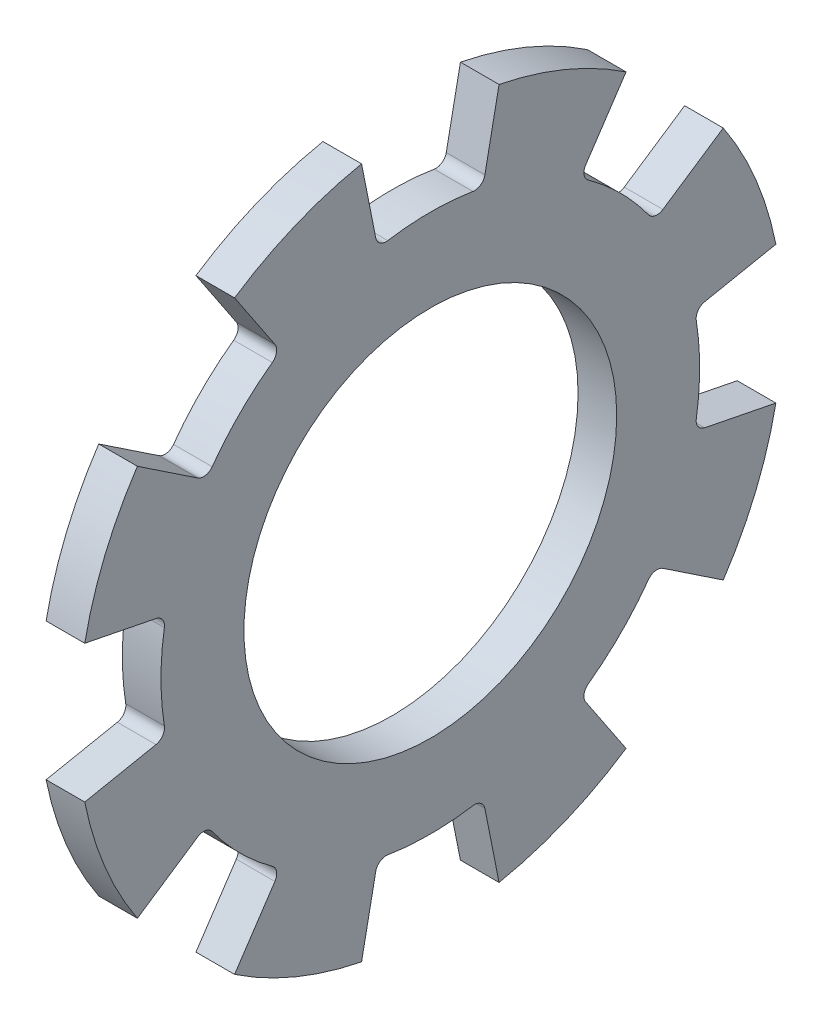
ISO-10303-21;
HEADER;
FILE_DESCRIPTION(('STEP AP214'),'2;1');
FILE_NAME('part.step','',(''),(''),'','','');
FILE_SCHEMA(('AUTOMOTIVE_DESIGN { 1 0 10303 214 1 1 1 1 }'));
ENDSEC;
DATA;
#1=APPLICATION_CONTEXT('core data for automotive mechanical design processes');
#2=APPLICATION_PROTOCOL_DEFINITION('international standard','automotive_design',2000,#1);
#3=PRODUCT_CONTEXT('',#1,'mechanical');
#4=PRODUCT('Part','Part','',(#3));
#5=PRODUCT_RELATED_PRODUCT_CATEGORY('part','',(#4));
#6=PRODUCT_DEFINITION_FORMATION('','',#4);
#7=PRODUCT_DEFINITION_CONTEXT('part definition',#1,'design');
#8=PRODUCT_DEFINITION('design','',#6,#7);
#9=PRODUCT_DEFINITION_SHAPE('','',#8);
#10=(LENGTH_UNIT() NAMED_UNIT(*) SI_UNIT(.MILLI.,.METRE.));
#11=(NAMED_UNIT(*) PLANE_ANGLE_UNIT() SI_UNIT($,.RADIAN.));
#12=(NAMED_UNIT(*) SI_UNIT($,.STERADIAN.) SOLID_ANGLE_UNIT());
#13=UNCERTAINTY_MEASURE_WITH_UNIT(LENGTH_MEASURE(1.E-05),#10,'distance_accuracy_value','');
#14=(GEOMETRIC_REPRESENTATION_CONTEXT(3) GLOBAL_UNCERTAINTY_ASSIGNED_CONTEXT((#13)) GLOBAL_UNIT_ASSIGNED_CONTEXT((#10,
#11,#12)) REPRESENTATION_CONTEXT('',''));
#15=CARTESIAN_POINT('',(0.,0.,0.));
#16=DIRECTION('',(0.,0.,1.));
#17=DIRECTION('',(1.,0.,0.));
#18=AXIS2_PLACEMENT_3D('',#15,#16,#17);
#19=CARTESIAN_POINT('',(0.85,0.,0.));
#20=DIRECTION('',(-1.,0.,0.));
#21=DIRECTION('',(0.,0.,1.));
#22=AXIS2_PLACEMENT_3D('',#19,#20,#21);
#23=PLANE('',#22);
#24=CARTESIAN_POINT('',(0.85,-0.972379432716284,-6.08023720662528));
#25=DIRECTION('',(-1.,0.,0.));
#26=DIRECTION('',(0.,0.,1.));
#27=AXIS2_PLACEMENT_3D('',#24,#25,#26);
#28=CIRCLE('',#27,0.2325);
#29=CARTESIAN_POINT('',(0.85,-0.935663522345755,-5.85065455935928));
#30=VERTEX_POINT('',#29);
#31=CARTESIAN_POINT('',(0.85,-1.20041201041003,-6.03487870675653));
#32=VERTEX_POINT('',#31);
#33=EDGE_CURVE('E519',#30,#32,#28,.F.);
#34=ORIENTED_EDGE('',*,*,#33,.F.);
#35=CARTESIAN_POINT('',(0.85,0.,0.));
#36=DIRECTION('',(-1.,0.,0.));
#37=DIRECTION('',(0.,0.,1.));
#38=AXIS2_PLACEMENT_3D('',#35,#36,#37);
#39=CIRCLE('',#38,5.925);
#40=CARTESIAN_POINT('',(0.85,0.935663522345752,-5.85065455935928));
#41=VERTEX_POINT('',#40);
#42=EDGE_CURVE('E524',#30,#41,#39,.F.);
#43=ORIENTED_EDGE('',*,*,#42,.T.);
#44=CARTESIAN_POINT('',(0.85,0.972379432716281,-6.08023720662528));
#45=DIRECTION('',(-1.,0.,0.));
#46=DIRECTION('',(0.,0.,1.));
#47=AXIS2_PLACEMENT_3D('',#44,#45,#46);
#48=CIRCLE('',#47,0.2325);
#49=CARTESIAN_POINT('',(0.85,1.20041201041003,-6.03487870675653));
#50=VERTEX_POINT('',#49);
#51=EDGE_CURVE('E527',#50,#41,#48,.F.);
#52=ORIENTED_EDGE('',*,*,#51,.F.);
#53=DIRECTION('',(0.,-0.195090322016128,0.98078528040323));
#54=VECTOR('',#53,1.);
#55=CARTESIAN_POINT('',(0.85,1.511949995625,-7.60108592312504));
#56=LINE('',#55,#54);
#57=CARTESIAN_POINT('',(0.85,1.511949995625,-7.60108592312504));
#58=VERTEX_POINT('',#57);
#59=EDGE_CURVE('E351',#50,#58,#56,.F.);
#60=ORIENTED_EDGE('',*,*,#59,.T.);
#61=CARTESIAN_POINT('',(0.85,0.,0.));
#62=DIRECTION('',(1.,0.,0.));
#63=DIRECTION('',(0.,0.,-1.));
#64=AXIS2_PLACEMENT_3D('',#61,#62,#63);
#65=CIRCLE('',#64,7.75);
#66=CARTESIAN_POINT('',(0.85,4.30566930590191,-6.44388949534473));
#67=VERTEX_POINT('',#66);
#68=EDGE_CURVE('E354',#67,#58,#65,.F.);
#69=ORIENTED_EDGE('',*,*,#68,.F.);
#70=DIRECTION('',(0.,0.555570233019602,-0.831469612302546));
#71=VECTOR('',#70,1.);
#72=CARTESIAN_POINT('',(0.85,3.29175363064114,-4.92645745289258));
#73=LINE('',#72,#71);
#74=CARTESIAN_POINT('',(0.85,3.41848418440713,-5.11612312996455));
#75=VERTEX_POINT('',#74);
#76=EDGE_CURVE('E355',#67,#75,#73,.F.);
#77=ORIENTED_EDGE('',*,*,#76,.T.);
#78=CARTESIAN_POINT('',(0.85,3.61180086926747,-4.9869530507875));
#79=DIRECTION('',(-1.,0.,0.));
#80=DIRECTION('',(0.,0.,1.));
#81=AXIS2_PLACEMENT_3D('',#78,#79,#80);
#82=CIRCLE('',#81,0.2325);
#83=CARTESIAN_POINT('',(0.85,3.47542349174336,-4.79865153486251));
#84=VERTEX_POINT('',#83);
#85=EDGE_CURVE('E533',#84,#75,#82,.F.);
#86=ORIENTED_EDGE('',*,*,#85,.F.);
#87=CARTESIAN_POINT('',(0.85,0.,0.));
#88=DIRECTION('',(-1.,0.,0.));
#89=DIRECTION('',(0.,0.,1.));
#90=AXIS2_PLACEMENT_3D('',#87,#88,#89);
#91=CIRCLE('',#90,5.925);
#92=CARTESIAN_POINT('',(0.85,4.79865153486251,-3.47542349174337));
#93=VERTEX_POINT('',#92);
#94=EDGE_CURVE('E537',#84,#93,#91,.F.);
#95=ORIENTED_EDGE('',*,*,#94,.T.);
#96=CARTESIAN_POINT('',(0.85,4.98695305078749,-3.61180086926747));
#97=DIRECTION('',(-1.,0.,0.));
#98=DIRECTION('',(0.,0.,1.));
#99=AXIS2_PLACEMENT_3D('',#96,#97,#98);
#100=CIRCLE('',#99,0.2325);
#101=CARTESIAN_POINT('',(0.85,5.11612312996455,-3.41848418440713));
#102=VERTEX_POINT('',#101);
#103=EDGE_CURVE('E540',#102,#93,#100,.F.);
#104=ORIENTED_EDGE('',*,*,#103,.F.);
#105=DIRECTION('',(0.,-0.831469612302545,0.555570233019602));
#106=VECTOR('',#105,1.);
#107=CARTESIAN_POINT('',(0.85,6.44388949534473,-4.30566930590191));
#108=LINE('',#107,#106);
#109=CARTESIAN_POINT('',(0.85,6.44388949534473,-4.30566930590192));
#110=VERTEX_POINT('',#109);
#111=EDGE_CURVE('E359',#102,#110,#108,.F.);
#112=ORIENTED_EDGE('',*,*,#111,.T.);
#113=CARTESIAN_POINT('',(0.85,0.,0.));
#114=DIRECTION('',(1.,0.,0.));
#115=DIRECTION('',(0.,0.,-1.));
#116=AXIS2_PLACEMENT_3D('',#113,#114,#115);
#117=CIRCLE('',#116,7.75);
#118=CARTESIAN_POINT('',(0.85,7.60108592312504,-1.511949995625));
#119=VERTEX_POINT('',#118);
#120=EDGE_CURVE('E362',#119,#110,#117,.F.);
#121=ORIENTED_EDGE('',*,*,#120,.F.);
#122=DIRECTION('',(0.,0.98078528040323,-0.195090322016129));
#123=VECTOR('',#122,1.);
#124=CARTESIAN_POINT('',(0.85,5.81115278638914,-1.15591015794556));
#125=LINE('',#124,#123);
#126=CARTESIAN_POINT('',(0.85,6.03487870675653,-1.20041201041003));
#127=VERTEX_POINT('',#126);
#128=EDGE_CURVE('E363',#119,#127,#125,.F.);
#129=ORIENTED_EDGE('',*,*,#128,.T.);
#130=CARTESIAN_POINT('',(0.85,6.08023720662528,-0.972379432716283));
#131=DIRECTION('',(-1.,0.,0.));
#132=DIRECTION('',(0.,0.,1.));
#133=AXIS2_PLACEMENT_3D('',#130,#131,#132);
#134=CIRCLE('',#133,0.2325);
#135=CARTESIAN_POINT('',(0.85,5.85065455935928,-0.935663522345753));
#136=VERTEX_POINT('',#135);
#137=EDGE_CURVE('E546',#136,#127,#134,.F.);
#138=ORIENTED_EDGE('',*,*,#137,.F.);
#139=CARTESIAN_POINT('',(0.85,0.,0.));
#140=DIRECTION('',(-1.,0.,0.));
#141=DIRECTION('',(0.,0.,1.));
#142=AXIS2_PLACEMENT_3D('',#139,#140,#141);
#143=CIRCLE('',#142,5.925);
#144=CARTESIAN_POINT('',(0.85,5.85065455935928,0.935663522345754));
#145=VERTEX_POINT('',#144);
#146=EDGE_CURVE('E550',#136,#145,#143,.F.);
#147=ORIENTED_EDGE('',*,*,#146,.T.);
#148=CARTESIAN_POINT('',(0.85,6.08023720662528,0.972379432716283));
#149=DIRECTION('',(-1.,0.,0.));
#150=DIRECTION('',(0.,0.,1.));
#151=AXIS2_PLACEMENT_3D('',#148,#149,#150);
#152=CIRCLE('',#151,0.2325);
#153=CARTESIAN_POINT('',(0.85,6.03487870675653,1.20041201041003));
#154=VERTEX_POINT('',#153);
#155=EDGE_CURVE('E553',#154,#145,#152,.F.);
#156=ORIENTED_EDGE('',*,*,#155,.F.);
#157=DIRECTION('',(0.,-0.98078528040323,-0.195090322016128));
#158=VECTOR('',#157,1.);
#159=CARTESIAN_POINT('',(0.85,7.60108592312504,1.511949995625));
#160=LINE('',#159,#158);
#161=CARTESIAN_POINT('',(0.85,7.60108592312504,1.511949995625));
#162=VERTEX_POINT('',#161);
#163=EDGE_CURVE('E367',#154,#162,#160,.F.);
#164=ORIENTED_EDGE('',*,*,#163,.T.);
#165=CARTESIAN_POINT('',(0.85,0.,0.));
#166=DIRECTION('',(1.,0.,0.));
#167=DIRECTION('',(0.,0.,-1.));
#168=AXIS2_PLACEMENT_3D('',#165,#166,#167);
#169=CIRCLE('',#168,7.75);
#170=CARTESIAN_POINT('',(0.85,6.44388949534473,4.30566930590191));
#171=VERTEX_POINT('',#170);
#172=EDGE_CURVE('E370',#171,#162,#169,.F.);
#173=ORIENTED_EDGE('',*,*,#172,.F.);
#174=DIRECTION('',(0.,0.831469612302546,0.555570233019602));
#175=VECTOR('',#174,1.);
#176=CARTESIAN_POINT('',(0.85,4.92645745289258,3.29175363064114));
#177=LINE('',#176,#175);
#178=CARTESIAN_POINT('',(0.85,5.11612312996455,3.41848418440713));
#179=VERTEX_POINT('',#178);
#180=EDGE_CURVE('E371',#171,#179,#177,.F.);
#181=ORIENTED_EDGE('',*,*,#180,.T.);
#182=CARTESIAN_POINT('',(0.85,4.9869530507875,3.61180086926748));
#183=DIRECTION('',(-1.,0.,0.));
#184=DIRECTION('',(0.,0.,1.));
#185=AXIS2_PLACEMENT_3D('',#182,#183,#184);
#186=CIRCLE('',#185,0.2325);
#187=CARTESIAN_POINT('',(0.85,4.79865153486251,3.47542349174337));
#188=VERTEX_POINT('',#187);
#189=EDGE_CURVE('E559',#188,#179,#186,.F.);
#190=ORIENTED_EDGE('',*,*,#189,.F.);
#191=CARTESIAN_POINT('',(0.85,0.,0.));
#192=DIRECTION('',(-1.,0.,0.));
#193=DIRECTION('',(0.,0.,1.));
#194=AXIS2_PLACEMENT_3D('',#191,#192,#193);
#195=CIRCLE('',#194,5.925);
#196=CARTESIAN_POINT('',(0.85,3.47542349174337,4.79865153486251));
#197=VERTEX_POINT('',#196);
#198=EDGE_CURVE('E563',#188,#197,#195,.F.);
#199=ORIENTED_EDGE('',*,*,#198,.T.);
#200=CARTESIAN_POINT('',(0.85,3.61180086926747,4.9869530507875));
#201=DIRECTION('',(-1.,0.,0.));
#202=DIRECTION('',(0.,0.,1.));
#203=AXIS2_PLACEMENT_3D('',#200,#201,#202);
#204=CIRCLE('',#203,0.2325);
#205=CARTESIAN_POINT('',(0.85,3.41848418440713,5.11612312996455));
#206=VERTEX_POINT('',#205);
#207=EDGE_CURVE('E566',#206,#197,#204,.F.);
#208=ORIENTED_EDGE('',*,*,#207,.F.);
#209=DIRECTION('',(0.,-0.555570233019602,-0.831469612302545));
#210=VECTOR('',#209,1.);
#211=CARTESIAN_POINT('',(0.85,4.30566930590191,6.44388949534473));
#212=LINE('',#211,#210);
#213=CARTESIAN_POINT('',(0.85,4.30566930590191,6.44388949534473));
#214=VERTEX_POINT('',#213);
#215=EDGE_CURVE('E375',#206,#214,#212,.F.);
#216=ORIENTED_EDGE('',*,*,#215,.T.);
#217=CARTESIAN_POINT('',(0.85,0.,0.));
#218=DIRECTION('',(1.,0.,0.));
#219=DIRECTION('',(0.,0.,-1.));
#220=AXIS2_PLACEMENT_3D('',#217,#218,#219);
#221=CIRCLE('',#220,7.75);
#222=CARTESIAN_POINT('',(0.85,1.511949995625,7.60108592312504));
#223=VERTEX_POINT('',#222);
#224=EDGE_CURVE('E378',#223,#214,#221,.F.);
#225=ORIENTED_EDGE('',*,*,#224,.F.);
#226=DIRECTION('',(0.,0.195090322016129,0.98078528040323));
#227=VECTOR('',#226,1.);
#228=CARTESIAN_POINT('',(0.85,1.15591015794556,5.81115278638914));
#229=LINE('',#228,#227);
#230=CARTESIAN_POINT('',(0.85,1.20041201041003,6.03487870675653));
#231=VERTEX_POINT('',#230);
#232=EDGE_CURVE('E379',#223,#231,#229,.F.);
#233=ORIENTED_EDGE('',*,*,#232,.T.);
#234=CARTESIAN_POINT('',(0.85,0.972379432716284,6.08023720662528));
#235=DIRECTION('',(-1.,0.,0.));
#236=DIRECTION('',(0.,0.,1.));
#237=AXIS2_PLACEMENT_3D('',#234,#235,#236);
#238=CIRCLE('',#237,0.2325);
#239=CARTESIAN_POINT('',(0.85,0.935663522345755,5.85065455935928));
#240=VERTEX_POINT('',#239);
#241=EDGE_CURVE('E572',#240,#231,#238,.F.);
#242=ORIENTED_EDGE('',*,*,#241,.F.);
#243=CARTESIAN_POINT('',(0.85,0.,0.));
#244=DIRECTION('',(-1.,0.,0.));
#245=DIRECTION('',(0.,0.,1.));
#246=AXIS2_PLACEMENT_3D('',#243,#244,#245);
#247=CIRCLE('',#246,5.925);
#248=CARTESIAN_POINT('',(0.85,-0.935663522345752,5.85065455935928));
#249=VERTEX_POINT('',#248);
#250=EDGE_CURVE('E576',#240,#249,#247,.F.);
#251=ORIENTED_EDGE('',*,*,#250,.T.);
#252=CARTESIAN_POINT('',(0.85,-0.972379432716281,6.08023720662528));
#253=DIRECTION('',(-1.,0.,0.));
#254=DIRECTION('',(0.,0.,1.));
#255=AXIS2_PLACEMENT_3D('',#252,#253,#254);
#256=CIRCLE('',#255,0.2325);
#257=CARTESIAN_POINT('',(0.85,-1.20041201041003,6.03487870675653));
#258=VERTEX_POINT('',#257);
#259=EDGE_CURVE('E579',#258,#249,#256,.F.);
#260=ORIENTED_EDGE('',*,*,#259,.F.);
#261=DIRECTION('',(0.,0.195090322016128,-0.98078528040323));
#262=VECTOR('',#261,1.);
#263=CARTESIAN_POINT('',(0.85,-1.511949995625,7.60108592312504));
#264=LINE('',#263,#262);
#265=CARTESIAN_POINT('',(0.85,-1.511949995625,7.60108592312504));
#266=VERTEX_POINT('',#265);
#267=EDGE_CURVE('E383',#258,#266,#264,.F.);
#268=ORIENTED_EDGE('',*,*,#267,.T.);
#269=CARTESIAN_POINT('',(0.85,0.,0.));
#270=DIRECTION('',(1.,0.,0.));
#271=DIRECTION('',(0.,0.,-1.));
#272=AXIS2_PLACEMENT_3D('',#269,#270,#271);
#273=CIRCLE('',#272,7.75);
#274=CARTESIAN_POINT('',(0.85,-4.30566930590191,6.44388949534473));
#275=VERTEX_POINT('',#274);
#276=EDGE_CURVE('E386',#275,#266,#273,.F.);
#277=ORIENTED_EDGE('',*,*,#276,.F.);
#278=DIRECTION('',(0.,-0.555570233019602,0.831469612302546));
#279=VECTOR('',#278,1.);
#280=CARTESIAN_POINT('',(0.85,-3.29175363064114,4.92645745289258));
#281=LINE('',#280,#279);
#282=CARTESIAN_POINT('',(0.85,-3.41848418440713,5.11612312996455));
#283=VERTEX_POINT('',#282);
#284=EDGE_CURVE('E387',#275,#283,#281,.F.);
#285=ORIENTED_EDGE('',*,*,#284,.T.);
#286=CARTESIAN_POINT('',(0.85,-3.61180086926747,4.9869530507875));
#287=DIRECTION('',(-1.,0.,0.));
#288=DIRECTION('',(0.,0.,1.));
#289=AXIS2_PLACEMENT_3D('',#286,#287,#288);
#290=CIRCLE('',#289,0.2325);
#291=CARTESIAN_POINT('',(0.85,-3.47542349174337,4.79865153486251));
#292=VERTEX_POINT('',#291);
#293=EDGE_CURVE('E585',#292,#283,#290,.F.);
#294=ORIENTED_EDGE('',*,*,#293,.F.);
#295=CARTESIAN_POINT('',(0.85,0.,0.));
#296=DIRECTION('',(-1.,0.,0.));
#297=DIRECTION('',(0.,0.,1.));
#298=AXIS2_PLACEMENT_3D('',#295,#296,#297);
#299=CIRCLE('',#298,5.925);
#300=CARTESIAN_POINT('',(0.85,-4.79865153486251,3.47542349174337));
#301=VERTEX_POINT('',#300);
#302=EDGE_CURVE('E589',#292,#301,#299,.F.);
#303=ORIENTED_EDGE('',*,*,#302,.T.);
#304=CARTESIAN_POINT('',(0.85,-4.9869530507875,3.61180086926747));
#305=DIRECTION('',(-1.,0.,0.));
#306=DIRECTION('',(0.,0.,1.));
#307=AXIS2_PLACEMENT_3D('',#304,#305,#306);
#308=CIRCLE('',#307,0.2325);
#309=CARTESIAN_POINT('',(0.85,-5.11612312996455,3.41848418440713));
#310=VERTEX_POINT('',#309);
#311=EDGE_CURVE('E592',#310,#301,#308,.F.);
#312=ORIENTED_EDGE('',*,*,#311,.F.);
#313=DIRECTION('',(0.,0.831469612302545,-0.555570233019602));
#314=VECTOR('',#313,1.);
#315=CARTESIAN_POINT('',(0.85,-6.44388949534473,4.30566930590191));
#316=LINE('',#315,#314);
#317=CARTESIAN_POINT('',(0.85,-6.44388949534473,4.30566930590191));
#318=VERTEX_POINT('',#317);
#319=EDGE_CURVE('E391',#310,#318,#316,.F.);
#320=ORIENTED_EDGE('',*,*,#319,.T.);
#321=CARTESIAN_POINT('',(0.85,0.,0.));
#322=DIRECTION('',(1.,0.,0.));
#323=DIRECTION('',(0.,0.,-1.));
#324=AXIS2_PLACEMENT_3D('',#321,#322,#323);
#325=CIRCLE('',#324,7.75);
#326=CARTESIAN_POINT('',(0.85,-7.60108592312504,1.511949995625));
#327=VERTEX_POINT('',#326);
#328=EDGE_CURVE('E394',#327,#318,#325,.F.);
#329=ORIENTED_EDGE('',*,*,#328,.F.);
#330=DIRECTION('',(0.,-0.98078528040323,0.195090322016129));
#331=VECTOR('',#330,1.);
#332=CARTESIAN_POINT('',(0.85,-5.81115278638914,1.15591015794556));
#333=LINE('',#332,#331);
#334=CARTESIAN_POINT('',(0.85,-6.03487870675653,1.20041201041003));
#335=VERTEX_POINT('',#334);
#336=EDGE_CURVE('E395',#327,#335,#333,.F.);
#337=ORIENTED_EDGE('',*,*,#336,.T.);
#338=CARTESIAN_POINT('',(0.85,-6.08023720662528,0.972379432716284));
#339=DIRECTION('',(-1.,0.,0.));
#340=DIRECTION('',(0.,0.,1.));
#341=AXIS2_PLACEMENT_3D('',#338,#339,#340);
#342=CIRCLE('',#341,0.2325);
#343=CARTESIAN_POINT('',(0.85,-5.85065455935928,0.935663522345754));
#344=VERTEX_POINT('',#343);
#345=EDGE_CURVE('E598',#344,#335,#342,.F.);
#346=ORIENTED_EDGE('',*,*,#345,.F.);
#347=CARTESIAN_POINT('',(0.85,0.,0.));
#348=DIRECTION('',(-1.,0.,0.));
#349=DIRECTION('',(0.,0.,1.));
#350=AXIS2_PLACEMENT_3D('',#347,#348,#349);
#351=CIRCLE('',#350,5.925);
#352=CARTESIAN_POINT('',(0.85,-5.85065455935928,-0.935663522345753));
#353=VERTEX_POINT('',#352);
#354=EDGE_CURVE('E602',#344,#353,#351,.F.);
#355=ORIENTED_EDGE('',*,*,#354,.T.);
#356=CARTESIAN_POINT('',(0.85,-6.08023720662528,-0.972379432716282));
#357=DIRECTION('',(-1.,0.,0.));
#358=DIRECTION('',(0.,0.,1.));
#359=AXIS2_PLACEMENT_3D('',#356,#357,#358);
#360=CIRCLE('',#359,0.2325);
#361=CARTESIAN_POINT('',(0.85,-6.03487870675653,-1.20041201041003));
#362=VERTEX_POINT('',#361);
#363=EDGE_CURVE('E605',#362,#353,#360,.F.);
#364=ORIENTED_EDGE('',*,*,#363,.F.);
#365=DIRECTION('',(0.,0.98078528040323,0.195090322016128));
#366=VECTOR('',#365,1.);
#367=CARTESIAN_POINT('',(0.85,-7.60108592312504,-1.511949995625));
#368=LINE('',#367,#366);
#369=CARTESIAN_POINT('',(0.85,-7.60108592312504,-1.511949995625));
#370=VERTEX_POINT('',#369);
#371=EDGE_CURVE('E399',#362,#370,#368,.F.);
#372=ORIENTED_EDGE('',*,*,#371,.T.);
#373=CARTESIAN_POINT('',(0.85,0.,0.));
#374=DIRECTION('',(1.,0.,0.));
#375=DIRECTION('',(0.,0.,-1.));
#376=AXIS2_PLACEMENT_3D('',#373,#374,#375);
#377=CIRCLE('',#376,7.75);
#378=CARTESIAN_POINT('',(0.85,-6.44388949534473,-4.30566930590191));
#379=VERTEX_POINT('',#378);
#380=EDGE_CURVE('E402',#379,#370,#377,.F.);
#381=ORIENTED_EDGE('',*,*,#380,.F.);
#382=DIRECTION('',(0.,-0.831469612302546,-0.555570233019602));
#383=VECTOR('',#382,1.);
#384=CARTESIAN_POINT('',(0.85,-4.92645745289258,-3.29175363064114));
#385=LINE('',#384,#383);
#386=CARTESIAN_POINT('',(0.85,-5.11612312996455,-3.41848418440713));
#387=VERTEX_POINT('',#386);
#388=EDGE_CURVE('E403',#379,#387,#385,.F.);
#389=ORIENTED_EDGE('',*,*,#388,.T.);
#390=CARTESIAN_POINT('',(0.85,-4.9869530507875,-3.61180086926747));
#391=DIRECTION('',(-1.,0.,0.));
#392=DIRECTION('',(0.,0.,1.));
#393=AXIS2_PLACEMENT_3D('',#390,#391,#392);
#394=CIRCLE('',#393,0.2325);
#395=CARTESIAN_POINT('',(0.85,-4.79865153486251,-3.47542349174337));
#396=VERTEX_POINT('',#395);
#397=EDGE_CURVE('E611',#396,#387,#394,.F.);
#398=ORIENTED_EDGE('',*,*,#397,.F.);
#399=CARTESIAN_POINT('',(0.85,0.,0.));
#400=DIRECTION('',(-1.,0.,0.));
#401=DIRECTION('',(0.,0.,1.));
#402=AXIS2_PLACEMENT_3D('',#399,#400,#401);
#403=CIRCLE('',#402,5.925);
#404=CARTESIAN_POINT('',(0.85,-3.47542349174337,-4.79865153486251));
#405=VERTEX_POINT('',#404);
#406=EDGE_CURVE('E615',#396,#405,#403,.F.);
#407=ORIENTED_EDGE('',*,*,#406,.T.);
#408=CARTESIAN_POINT('',(0.85,-3.61180086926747,-4.9869530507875));
#409=DIRECTION('',(-1.,0.,0.));
#410=DIRECTION('',(0.,0.,1.));
#411=AXIS2_PLACEMENT_3D('',#408,#409,#410);
#412=CIRCLE('',#411,0.2325);
#413=CARTESIAN_POINT('',(0.85,-3.41848418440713,-5.11612312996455));
#414=VERTEX_POINT('',#413);
#415=EDGE_CURVE('E329',#414,#405,#412,.F.);
#416=ORIENTED_EDGE('',*,*,#415,.F.);
#417=DIRECTION('',(0.,0.555570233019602,0.831469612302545));
#418=VECTOR('',#417,1.);
#419=CARTESIAN_POINT('',(0.85,-4.30566930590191,-6.44388949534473));
#420=LINE('',#419,#418);
#421=CARTESIAN_POINT('',(0.85,-4.30566930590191,-6.44388949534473));
#422=VERTEX_POINT('',#421);
#423=EDGE_CURVE('E324',#414,#422,#420,.F.);
#424=ORIENTED_EDGE('',*,*,#423,.T.);
#425=CARTESIAN_POINT('',(0.85,0.,0.));
#426=DIRECTION('',(1.,0.,0.));
#427=DIRECTION('',(0.,0.,-1.));
#428=AXIS2_PLACEMENT_3D('',#425,#426,#427);
#429=CIRCLE('',#428,7.75);
#430=CARTESIAN_POINT('',(0.85,-1.511949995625,-7.60108592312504));
#431=VERTEX_POINT('',#430);
#432=EDGE_CURVE('E21',#431,#422,#429,.F.);
#433=ORIENTED_EDGE('',*,*,#432,.F.);
#434=DIRECTION('',(0.,-0.195090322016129,-0.98078528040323));
#435=VECTOR('',#434,1.);
#436=CARTESIAN_POINT('',(0.85,-1.15591015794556,-5.81115278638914));
#437=LINE('',#436,#435);
#438=EDGE_CURVE('E319',#431,#32,#437,.F.);
#439=ORIENTED_EDGE('',*,*,#438,.T.);
#440=EDGE_LOOP('',(#34,#43,#52,#60,#69,#77,#86,#95,#104,#112,#121,#129,#138,#147,#156,#164,#173,
#181,#190,#199,#208,#216,#225,#233,#242,#251,#260,#268,#277,#285,#294,#303,#312,#320,#329,#337,
#346,#355,#364,#372,#381,#389,#398,#407,#416,#424,#433,#439));
#441=FACE_BOUND('',#440,.T.);
#442=CARTESIAN_POINT('',(0.85,0.,0.));
#443=DIRECTION('',(1.,0.,0.));
#444=DIRECTION('',(0.,0.,-1.));
#445=AXIS2_PLACEMENT_3D('',#442,#443,#444);
#446=CIRCLE('',#445,4.1);
#447=CARTESIAN_POINT('',(0.85,0.,-4.1));
#448=VERTEX_POINT('',#447);
#449=EDGE_CURVE('E516',#448,#448,#446,.F.);
#450=ORIENTED_EDGE('',*,*,#449,.T.);
#451=EDGE_LOOP('',(#450));
#452=FACE_BOUND('',#451,.T.);
#453=ADVANCED_FACE('F17',(#441,#452),#23,.F.);
#454=CARTESIAN_POINT('',(0.85,-1.15591015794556,-5.81115278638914));
#455=DIRECTION('',(0.,-0.98078528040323,0.195090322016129));
#456=DIRECTION('',(0.,-0.195090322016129,-0.98078528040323));
#457=AXIS2_PLACEMENT_3D('',#454,#455,#456);
#458=PLANE('',#457);
#459=ORIENTED_EDGE('',*,*,#438,.F.);
#460=DIRECTION('',(1.,0.,0.));
#461=VECTOR('',#460,1.);
#462=CARTESIAN_POINT('',(0.,-1.511949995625,-7.60108592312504));
#463=LINE('',#462,#461);
#464=CARTESIAN_POINT('',(0.,-1.511949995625,-7.60108592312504));
#465=VERTEX_POINT('',#464);
#466=EDGE_CURVE('E339',#465,#431,#463,.T.);
#467=ORIENTED_EDGE('',*,*,#466,.F.);
#468=DIRECTION('',(0.,-0.195090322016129,-0.98078528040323));
#469=VECTOR('',#468,1.);
#470=CARTESIAN_POINT('',(0.,-1.20041201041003,-6.03487870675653));
#471=LINE('',#470,#469);
#472=CARTESIAN_POINT('',(0.,-1.20041201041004,-6.03487870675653));
#473=VERTEX_POINT('',#472);
#474=EDGE_CURVE('E515',#473,#465,#471,.T.);
#475=ORIENTED_EDGE('',*,*,#474,.F.);
#476=DIRECTION('',(-1.,0.,0.));
#477=VECTOR('',#476,1.);
#478=CARTESIAN_POINT('',(0.85,-1.20041201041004,-6.03487870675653));
#479=LINE('',#478,#477);
#480=EDGE_CURVE('E522',#32,#473,#479,.T.);
#481=ORIENTED_EDGE('',*,*,#480,.F.);
#482=EDGE_LOOP('',(#459,#467,#475,#481));
#483=FACE_BOUND('',#482,.T.);
#484=ADVANCED_FACE('F753',(#483),#458,.F.);
#485=CARTESIAN_POINT('',(0.,0.,0.));
#486=DIRECTION('',(1.,0.,0.));
#487=DIRECTION('',(0.,0.,-1.));
#488=AXIS2_PLACEMENT_3D('',#485,#486,#487);
#489=CYLINDRICAL_SURFACE('',#488,7.75);
#490=DIRECTION('',(1.,0.,0.));
#491=VECTOR('',#490,1.);
#492=CARTESIAN_POINT('',(0.85,-4.30566930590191,-6.44388949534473));
#493=LINE('',#492,#491);
#494=CARTESIAN_POINT('',(0.,-4.30566930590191,-6.44388949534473));
#495=VERTEX_POINT('',#494);
#496=EDGE_CURVE('E333',#422,#495,#493,.F.);
#497=ORIENTED_EDGE('',*,*,#496,.T.);
#498=CARTESIAN_POINT('',(0.,0.,0.));
#499=DIRECTION('',(1.,0.,0.));
#500=DIRECTION('',(0.,0.,-1.));
#501=AXIS2_PLACEMENT_3D('',#498,#499,#500);
#502=CIRCLE('',#501,7.75);
#503=EDGE_CURVE('E513',#465,#495,#502,.F.);
#504=ORIENTED_EDGE('',*,*,#503,.F.);
#505=ORIENTED_EDGE('',*,*,#466,.T.);
#506=ORIENTED_EDGE('',*,*,#432,.T.);
#507=EDGE_LOOP('',(#497,#504,#505,#506));
#508=FACE_BOUND('',#507,.T.);
#509=ADVANCED_FACE('F336',(#508),#489,.T.);
#510=CARTESIAN_POINT('',(0.85,-4.30566930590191,-6.44388949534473));
#511=DIRECTION('',(0.,0.831469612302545,-0.555570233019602));
#512=DIRECTION('',(0.,0.555570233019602,0.831469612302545));
#513=AXIS2_PLACEMENT_3D('',#510,#511,#512);
#514=PLANE('',#513);
#515=DIRECTION('',(0.,0.555570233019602,0.831469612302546));
#516=VECTOR('',#515,1.);
#517=CARTESIAN_POINT('',(0.,-4.30566930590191,-6.44388949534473));
#518=LINE('',#517,#516);
#519=CARTESIAN_POINT('',(0.,-3.41848418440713,-5.11612312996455));
#520=VERTEX_POINT('',#519);
#521=EDGE_CURVE('E342',#495,#520,#518,.T.);
#522=ORIENTED_EDGE('',*,*,#521,.F.);
#523=ORIENTED_EDGE('',*,*,#496,.F.);
#524=ORIENTED_EDGE('',*,*,#423,.F.);
#525=DIRECTION('',(-1.,0.,0.));
#526=VECTOR('',#525,1.);
#527=CARTESIAN_POINT('',(0.85,-3.41848418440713,-5.11612312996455));
#528=LINE('',#527,#526);
#529=EDGE_CURVE('E345',#520,#414,#528,.F.);
#530=ORIENTED_EDGE('',*,*,#529,.F.);
#531=EDGE_LOOP('',(#522,#523,#524,#530));
#532=FACE_BOUND('',#531,.T.);
#533=ADVANCED_FACE('F340',(#532),#514,.F.);
#534=CARTESIAN_POINT('',(0.85,-3.61180086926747,-4.9869530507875));
#535=DIRECTION('',(-1.,0.,0.));
#536=DIRECTION('',(0.,0.,1.));
#537=AXIS2_PLACEMENT_3D('',#534,#535,#536);
#538=CYLINDRICAL_SURFACE('',#537,0.2325);
#539=CARTESIAN_POINT('',(0.,-3.61180086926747,-4.9869530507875));
#540=DIRECTION('',(-1.,0.,0.));
#541=DIRECTION('',(0.,0.,1.));
#542=AXIS2_PLACEMENT_3D('',#539,#540,#541);
#543=CIRCLE('',#542,0.2325);
#544=CARTESIAN_POINT('',(0.,-3.47542349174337,-4.79865153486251));
#545=VERTEX_POINT('',#544);
#546=EDGE_CURVE('E510',#520,#545,#543,.F.);
#547=ORIENTED_EDGE('',*,*,#546,.F.);
#548=ORIENTED_EDGE('',*,*,#529,.T.);
#549=ORIENTED_EDGE('',*,*,#415,.T.);
#550=DIRECTION('',(-1.,0.,0.));
#551=VECTOR('',#550,1.);
#552=CARTESIAN_POINT('',(0.85,-3.47542349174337,-4.79865153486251));
#553=LINE('',#552,#551);
#554=EDGE_CURVE('E614',#405,#545,#553,.T.);
#555=ORIENTED_EDGE('',*,*,#554,.T.);
#556=EDGE_LOOP('',(#547,#548,#549,#555));
#557=FACE_BOUND('',#556,.T.);
#558=ADVANCED_FACE('F619',(#557),#538,.F.);
#559=CARTESIAN_POINT('',(0.85,0.,0.));
#560=DIRECTION('',(-1.,0.,0.));
#561=DIRECTION('',(0.,0.,1.));
#562=AXIS2_PLACEMENT_3D('',#559,#560,#561);
#563=CYLINDRICAL_SURFACE('',#562,5.925);
#564=CARTESIAN_POINT('',(0.,0.,0.));
#565=DIRECTION('',(-1.,0.,0.));
#566=DIRECTION('',(0.,0.,1.));
#567=AXIS2_PLACEMENT_3D('',#564,#565,#566);
#568=CIRCLE('',#567,5.925);
#569=CARTESIAN_POINT('',(0.,-4.79865153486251,-3.47542349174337));
#570=VERTEX_POINT('',#569);
#571=EDGE_CURVE('E507',#545,#570,#568,.T.);
#572=ORIENTED_EDGE('',*,*,#571,.F.);
#573=ORIENTED_EDGE('',*,*,#554,.F.);
#574=ORIENTED_EDGE('',*,*,#406,.F.);
#575=DIRECTION('',(-1.,0.,0.));
#576=VECTOR('',#575,1.);
#577=CARTESIAN_POINT('',(0.85,-4.79865153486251,-3.47542349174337));
#578=LINE('',#577,#576);
#579=EDGE_CURVE('E405',#570,#396,#578,.F.);
#580=ORIENTED_EDGE('',*,*,#579,.F.);
#581=EDGE_LOOP('',(#572,#573,#574,#580));
#582=FACE_BOUND('',#581,.T.);
#583=ADVANCED_FACE('F699',(#582),#563,.T.);
#584=CARTESIAN_POINT('',(0.85,-4.9869530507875,-3.61180086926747));
#585=DIRECTION('',(-1.,0.,0.));
#586=DIRECTION('',(0.,0.,1.));
#587=AXIS2_PLACEMENT_3D('',#584,#585,#586);
#588=CYLINDRICAL_SURFACE('',#587,0.2325);
#589=CARTESIAN_POINT('',(0.,-4.9869530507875,-3.61180086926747));
#590=DIRECTION('',(-1.,0.,0.));
#591=DIRECTION('',(0.,0.,1.));
#592=AXIS2_PLACEMENT_3D('',#589,#590,#591);
#593=CIRCLE('',#592,0.2325);
#594=CARTESIAN_POINT('',(0.,-5.11612312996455,-3.41848418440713));
#595=VERTEX_POINT('',#594);
#596=EDGE_CURVE('E504',#570,#595,#593,.F.);
#597=ORIENTED_EDGE('',*,*,#596,.F.);
#598=ORIENTED_EDGE('',*,*,#579,.T.);
#599=ORIENTED_EDGE('',*,*,#397,.T.);
#600=DIRECTION('',(1.,0.,0.));
#601=VECTOR('',#600,1.);
#602=CARTESIAN_POINT('',(0.85,-5.11612312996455,-3.41848418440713));
#603=LINE('',#602,#601);
#604=EDGE_CURVE('E404',#387,#595,#603,.F.);
#605=ORIENTED_EDGE('',*,*,#604,.T.);
#606=EDGE_LOOP('',(#597,#598,#599,#605));
#607=FACE_BOUND('',#606,.T.);
#608=ADVANCED_FACE('F696',(#607),#588,.F.);
#609=CARTESIAN_POINT('',(0.85,-4.92645745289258,-3.29175363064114));
#610=DIRECTION('',(0.,-0.555570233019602,0.831469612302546));
#611=DIRECTION('',(0.,-0.831469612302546,-0.555570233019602));
#612=AXIS2_PLACEMENT_3D('',#609,#610,#611);
#613=PLANE('',#612);
#614=ORIENTED_EDGE('',*,*,#388,.F.);
#615=DIRECTION('',(1.,0.,0.));
#616=VECTOR('',#615,1.);
#617=CARTESIAN_POINT('',(0.,-6.44388949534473,-4.30566930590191));
#618=LINE('',#617,#616);
#619=CARTESIAN_POINT('',(0.,-6.44388949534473,-4.30566930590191));
#620=VERTEX_POINT('',#619);
#621=EDGE_CURVE('E610',#620,#379,#618,.T.);
#622=ORIENTED_EDGE('',*,*,#621,.F.);
#623=DIRECTION('',(0.,-0.831469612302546,-0.555570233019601));
#624=VECTOR('',#623,1.);
#625=CARTESIAN_POINT('',(0.,-5.11612312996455,-3.41848418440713));
#626=LINE('',#625,#624);
#627=EDGE_CURVE('E503',#595,#620,#626,.T.);
#628=ORIENTED_EDGE('',*,*,#627,.F.);
#629=ORIENTED_EDGE('',*,*,#604,.F.);
#630=EDGE_LOOP('',(#614,#622,#628,#629));
#631=FACE_BOUND('',#630,.T.);
#632=ADVANCED_FACE('F705',(#631),#613,.F.);
#633=CARTESIAN_POINT('',(0.,0.,0.));
#634=DIRECTION('',(1.,0.,0.));
#635=DIRECTION('',(0.,0.,-1.));
#636=AXIS2_PLACEMENT_3D('',#633,#634,#635);
#637=CYLINDRICAL_SURFACE('',#636,7.75);
#638=DIRECTION('',(1.,0.,0.));
#639=VECTOR('',#638,1.);
#640=CARTESIAN_POINT('',(0.85,-7.60108592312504,-1.511949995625));
#641=LINE('',#640,#639);
#642=CARTESIAN_POINT('',(0.,-7.60108592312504,-1.511949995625));
#643=VERTEX_POINT('',#642);
#644=EDGE_CURVE('E401',#370,#643,#641,.F.);
#645=ORIENTED_EDGE('',*,*,#644,.T.);
#646=CARTESIAN_POINT('',(0.,0.,0.));
#647=DIRECTION('',(1.,0.,0.));
#648=DIRECTION('',(0.,0.,-1.));
#649=AXIS2_PLACEMENT_3D('',#646,#647,#648);
#650=CIRCLE('',#649,7.75);
#651=EDGE_CURVE('E500',#620,#643,#650,.F.);
#652=ORIENTED_EDGE('',*,*,#651,.F.);
#653=ORIENTED_EDGE('',*,*,#621,.T.);
#654=ORIENTED_EDGE('',*,*,#380,.T.);
#655=EDGE_LOOP('',(#645,#652,#653,#654));
#656=FACE_BOUND('',#655,.T.);
#657=ADVANCED_FACE('F708',(#656),#637,.T.);
#658=CARTESIAN_POINT('',(0.85,-7.60108592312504,-1.511949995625));
#659=DIRECTION('',(0.,0.195090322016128,-0.98078528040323));
#660=DIRECTION('',(0.,0.98078528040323,0.195090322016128));
#661=AXIS2_PLACEMENT_3D('',#658,#659,#660);
#662=PLANE('',#661);
#663=DIRECTION('',(0.,0.98078528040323,0.195090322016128));
#664=VECTOR('',#663,1.);
#665=CARTESIAN_POINT('',(0.,-7.60108592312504,-1.511949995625));
#666=LINE('',#665,#664);
#667=CARTESIAN_POINT('',(0.,-6.03487870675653,-1.20041201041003));
#668=VERTEX_POINT('',#667);
#669=EDGE_CURVE('E499',#643,#668,#666,.T.);
#670=ORIENTED_EDGE('',*,*,#669,.F.);
#671=ORIENTED_EDGE('',*,*,#644,.F.);
#672=ORIENTED_EDGE('',*,*,#371,.F.);
#673=DIRECTION('',(-1.,0.,0.));
#674=VECTOR('',#673,1.);
#675=CARTESIAN_POINT('',(0.85,-6.03487870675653,-1.20041201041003));
#676=LINE('',#675,#674);
#677=EDGE_CURVE('E604',#668,#362,#676,.F.);
#678=ORIENTED_EDGE('',*,*,#677,.F.);
#679=EDGE_LOOP('',(#670,#671,#672,#678));
#680=FACE_BOUND('',#679,.T.);
#681=ADVANCED_FACE('F713',(#680),#662,.F.);
#682=CARTESIAN_POINT('',(0.85,-6.08023720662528,-0.972379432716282));
#683=DIRECTION('',(-1.,0.,0.));
#684=DIRECTION('',(0.,0.,1.));
#685=AXIS2_PLACEMENT_3D('',#682,#683,#684);
#686=CYLINDRICAL_SURFACE('',#685,0.2325);
#687=CARTESIAN_POINT('',(0.,-6.08023720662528,-0.972379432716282));
#688=DIRECTION('',(-1.,0.,0.));
#689=DIRECTION('',(0.,0.,1.));
#690=AXIS2_PLACEMENT_3D('',#687,#688,#689);
#691=CIRCLE('',#690,0.2325);
#692=CARTESIAN_POINT('',(0.,-5.85065455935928,-0.935663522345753));
#693=VERTEX_POINT('',#692);
#694=EDGE_CURVE('E496',#668,#693,#691,.F.);
#695=ORIENTED_EDGE('',*,*,#694,.F.);
#696=ORIENTED_EDGE('',*,*,#677,.T.);
#697=ORIENTED_EDGE('',*,*,#363,.T.);
#698=DIRECTION('',(-1.,0.,0.));
#699=VECTOR('',#698,1.);
#700=CARTESIAN_POINT('',(0.85,-5.85065455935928,-0.935663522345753));
#701=LINE('',#700,#699);
#702=EDGE_CURVE('E601',#353,#693,#701,.T.);
#703=ORIENTED_EDGE('',*,*,#702,.T.);
#704=EDGE_LOOP('',(#695,#696,#697,#703));
#705=FACE_BOUND('',#704,.T.);
#706=ADVANCED_FACE('F919',(#705),#686,.F.);
#707=CARTESIAN_POINT('',(0.85,0.,0.));
#708=DIRECTION('',(-1.,0.,0.));
#709=DIRECTION('',(0.,0.,1.));
#710=AXIS2_PLACEMENT_3D('',#707,#708,#709);
#711=CYLINDRICAL_SURFACE('',#710,5.925);
#712=CARTESIAN_POINT('',(0.,0.,0.));
#713=DIRECTION('',(-1.,0.,0.));
#714=DIRECTION('',(0.,0.,1.));
#715=AXIS2_PLACEMENT_3D('',#712,#713,#714);
#716=CIRCLE('',#715,5.925);
#717=CARTESIAN_POINT('',(0.,-5.85065455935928,0.935663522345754));
#718=VERTEX_POINT('',#717);
#719=EDGE_CURVE('E493',#693,#718,#716,.T.);
#720=ORIENTED_EDGE('',*,*,#719,.F.);
#721=ORIENTED_EDGE('',*,*,#702,.F.);
#722=ORIENTED_EDGE('',*,*,#354,.F.);
#723=DIRECTION('',(-1.,0.,0.));
#724=VECTOR('',#723,1.);
#725=CARTESIAN_POINT('',(0.85,-5.85065455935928,0.935663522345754));
#726=LINE('',#725,#724);
#727=EDGE_CURVE('E398',#718,#344,#726,.F.);
#728=ORIENTED_EDGE('',*,*,#727,.F.);
#729=EDGE_LOOP('',(#720,#721,#722,#728));
#730=FACE_BOUND('',#729,.T.);
#731=ADVANCED_FACE('F915',(#730),#711,.T.);
#732=CARTESIAN_POINT('',(0.85,-6.08023720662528,0.972379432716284));
#733=DIRECTION('',(-1.,0.,0.));
#734=DIRECTION('',(0.,0.,1.));
#735=AXIS2_PLACEMENT_3D('',#732,#733,#734);
#736=CYLINDRICAL_SURFACE('',#735,0.2325);
#737=CARTESIAN_POINT('',(0.,-6.08023720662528,0.972379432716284));
#738=DIRECTION('',(-1.,0.,0.));
#739=DIRECTION('',(0.,0.,1.));
#740=AXIS2_PLACEMENT_3D('',#737,#738,#739);
#741=CIRCLE('',#740,0.2325);
#742=CARTESIAN_POINT('',(0.,-6.03487870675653,1.20041201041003));
#743=VERTEX_POINT('',#742);
#744=EDGE_CURVE('E490',#718,#743,#741,.F.);
#745=ORIENTED_EDGE('',*,*,#744,.F.);
#746=ORIENTED_EDGE('',*,*,#727,.T.);
#747=ORIENTED_EDGE('',*,*,#345,.T.);
#748=DIRECTION('',(1.,0.,0.));
#749=VECTOR('',#748,1.);
#750=CARTESIAN_POINT('',(0.85,-6.03487870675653,1.20041201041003));
#751=LINE('',#750,#749);
#752=EDGE_CURVE('E397',#335,#743,#751,.F.);
#753=ORIENTED_EDGE('',*,*,#752,.T.);
#754=EDGE_LOOP('',(#745,#746,#747,#753));
#755=FACE_BOUND('',#754,.T.);
#756=ADVANCED_FACE('F911',(#755),#736,.F.);
#757=CARTESIAN_POINT('',(0.85,-5.81115278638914,1.15591015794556));
#758=DIRECTION('',(0.,0.195090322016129,0.98078528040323));
#759=DIRECTION('',(0.,-0.98078528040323,0.195090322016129));
#760=AXIS2_PLACEMENT_3D('',#757,#758,#759);
#761=PLANE('',#760);
#762=ORIENTED_EDGE('',*,*,#336,.F.);
#763=DIRECTION('',(1.,0.,0.));
#764=VECTOR('',#763,1.);
#765=CARTESIAN_POINT('',(0.,-7.60108592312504,1.511949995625));
#766=LINE('',#765,#764);
#767=CARTESIAN_POINT('',(0.,-7.60108592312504,1.511949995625));
#768=VERTEX_POINT('',#767);
#769=EDGE_CURVE('E597',#768,#327,#766,.T.);
#770=ORIENTED_EDGE('',*,*,#769,.F.);
#771=DIRECTION('',(0.,-0.98078528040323,0.195090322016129));
#772=VECTOR('',#771,1.);
#773=CARTESIAN_POINT('',(0.,-6.03487870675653,1.20041201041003));
#774=LINE('',#773,#772);
#775=EDGE_CURVE('E489',#743,#768,#774,.T.);
#776=ORIENTED_EDGE('',*,*,#775,.F.);
#777=ORIENTED_EDGE('',*,*,#752,.F.);
#778=EDGE_LOOP('',(#762,#770,#776,#777));
#779=FACE_BOUND('',#778,.T.);
#780=ADVANCED_FACE('F907',(#779),#761,.F.);
#781=CARTESIAN_POINT('',(0.,0.,0.));
#782=DIRECTION('',(1.,0.,0.));
#783=DIRECTION('',(0.,0.,-1.));
#784=AXIS2_PLACEMENT_3D('',#781,#782,#783);
#785=CYLINDRICAL_SURFACE('',#784,7.75);
#786=DIRECTION('',(1.,0.,0.));
#787=VECTOR('',#786,1.);
#788=CARTESIAN_POINT('',(0.85,-6.44388949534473,4.30566930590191));
#789=LINE('',#788,#787);
#790=CARTESIAN_POINT('',(0.,-6.44388949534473,4.30566930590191));
#791=VERTEX_POINT('',#790);
#792=EDGE_CURVE('E393',#318,#791,#789,.F.);
#793=ORIENTED_EDGE('',*,*,#792,.T.);
#794=CARTESIAN_POINT('',(0.,0.,0.));
#795=DIRECTION('',(1.,0.,0.));
#796=DIRECTION('',(0.,0.,-1.));
#797=AXIS2_PLACEMENT_3D('',#794,#795,#796);
#798=CIRCLE('',#797,7.75);
#799=EDGE_CURVE('E486',#768,#791,#798,.F.);
#800=ORIENTED_EDGE('',*,*,#799,.F.);
#801=ORIENTED_EDGE('',*,*,#769,.T.);
#802=ORIENTED_EDGE('',*,*,#328,.T.);
#803=EDGE_LOOP('',(#793,#800,#801,#802));
#804=FACE_BOUND('',#803,.T.);
#805=ADVANCED_FACE('F903',(#804),#785,.T.);
#806=CARTESIAN_POINT('',(0.85,-6.44388949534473,4.30566930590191));
#807=DIRECTION('',(0.,-0.555570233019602,-0.831469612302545));
#808=DIRECTION('',(0.,0.831469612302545,-0.555570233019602));
#809=AXIS2_PLACEMENT_3D('',#806,#807,#808);
#810=PLANE('',#809);
#811=DIRECTION('',(0.,0.831469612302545,-0.555570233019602));
#812=VECTOR('',#811,1.);
#813=CARTESIAN_POINT('',(0.,-6.44388949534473,4.30566930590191));
#814=LINE('',#813,#812);
#815=CARTESIAN_POINT('',(0.,-5.11612312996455,3.41848418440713));
#816=VERTEX_POINT('',#815);
#817=EDGE_CURVE('E485',#791,#816,#814,.T.);
#818=ORIENTED_EDGE('',*,*,#817,.F.);
#819=ORIENTED_EDGE('',*,*,#792,.F.);
#820=ORIENTED_EDGE('',*,*,#319,.F.);
#821=DIRECTION('',(-1.,0.,0.));
#822=VECTOR('',#821,1.);
#823=CARTESIAN_POINT('',(0.85,-5.11612312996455,3.41848418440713));
#824=LINE('',#823,#822);
#825=EDGE_CURVE('E591',#816,#310,#824,.F.);
#826=ORIENTED_EDGE('',*,*,#825,.F.);
#827=EDGE_LOOP('',(#818,#819,#820,#826));
#828=FACE_BOUND('',#827,.T.);
#829=ADVANCED_FACE('F899',(#828),#810,.F.);
#830=CARTESIAN_POINT('',(0.85,-4.9869530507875,3.61180086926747));
#831=DIRECTION('',(-1.,0.,0.));
#832=DIRECTION('',(0.,0.,1.));
#833=AXIS2_PLACEMENT_3D('',#830,#831,#832);
#834=CYLINDRICAL_SURFACE('',#833,0.2325);
#835=CARTESIAN_POINT('',(0.,-4.9869530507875,3.61180086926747));
#836=DIRECTION('',(-1.,0.,0.));
#837=DIRECTION('',(0.,0.,1.));
#838=AXIS2_PLACEMENT_3D('',#835,#836,#837);
#839=CIRCLE('',#838,0.2325);
#840=CARTESIAN_POINT('',(0.,-4.79865153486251,3.47542349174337));
#841=VERTEX_POINT('',#840);
#842=EDGE_CURVE('E482',#816,#841,#839,.F.);
#843=ORIENTED_EDGE('',*,*,#842,.F.);
#844=ORIENTED_EDGE('',*,*,#825,.T.);
#845=ORIENTED_EDGE('',*,*,#311,.T.);
#846=DIRECTION('',(-1.,0.,0.));
#847=VECTOR('',#846,1.);
#848=CARTESIAN_POINT('',(0.85,-4.79865153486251,3.47542349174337));
#849=LINE('',#848,#847);
#850=EDGE_CURVE('E588',#301,#841,#849,.T.);
#851=ORIENTED_EDGE('',*,*,#850,.T.);
#852=EDGE_LOOP('',(#843,#844,#845,#851));
#853=FACE_BOUND('',#852,.T.);
#854=ADVANCED_FACE('F895',(#853),#834,.F.);
#855=CARTESIAN_POINT('',(0.85,0.,0.));
#856=DIRECTION('',(-1.,0.,0.));
#857=DIRECTION('',(0.,0.,1.));
#858=AXIS2_PLACEMENT_3D('',#855,#856,#857);
#859=CYLINDRICAL_SURFACE('',#858,5.925);
#860=CARTESIAN_POINT('',(0.,0.,0.));
#861=DIRECTION('',(-1.,0.,0.));
#862=DIRECTION('',(0.,0.,1.));
#863=AXIS2_PLACEMENT_3D('',#860,#861,#862);
#864=CIRCLE('',#863,5.925);
#865=CARTESIAN_POINT('',(0.,-3.47542349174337,4.79865153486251));
#866=VERTEX_POINT('',#865);
#867=EDGE_CURVE('E479',#841,#866,#864,.T.);
#868=ORIENTED_EDGE('',*,*,#867,.F.);
#869=ORIENTED_EDGE('',*,*,#850,.F.);
#870=ORIENTED_EDGE('',*,*,#302,.F.);
#871=DIRECTION('',(-1.,0.,0.));
#872=VECTOR('',#871,1.);
#873=CARTESIAN_POINT('',(0.85,-3.47542349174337,4.79865153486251));
#874=LINE('',#873,#872);
#875=EDGE_CURVE('E390',#866,#292,#874,.F.);
#876=ORIENTED_EDGE('',*,*,#875,.F.);
#877=EDGE_LOOP('',(#868,#869,#870,#876));
#878=FACE_BOUND('',#877,.T.);
#879=ADVANCED_FACE('F891',(#878),#859,.T.);
#880=CARTESIAN_POINT('',(0.85,-3.61180086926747,4.9869530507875));
#881=DIRECTION('',(-1.,0.,0.));
#882=DIRECTION('',(0.,0.,1.));
#883=AXIS2_PLACEMENT_3D('',#880,#881,#882);
#884=CYLINDRICAL_SURFACE('',#883,0.2325);
#885=CARTESIAN_POINT('',(0.,-3.61180086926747,4.9869530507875));
#886=DIRECTION('',(-1.,0.,0.));
#887=DIRECTION('',(0.,0.,1.));
#888=AXIS2_PLACEMENT_3D('',#885,#886,#887);
#889=CIRCLE('',#888,0.2325);
#890=CARTESIAN_POINT('',(0.,-3.41848418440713,5.11612312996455));
#891=VERTEX_POINT('',#890);
#892=EDGE_CURVE('E476',#866,#891,#889,.F.);
#893=ORIENTED_EDGE('',*,*,#892,.F.);
#894=ORIENTED_EDGE('',*,*,#875,.T.);
#895=ORIENTED_EDGE('',*,*,#293,.T.);
#896=DIRECTION('',(1.,0.,0.));
#897=VECTOR('',#896,1.);
#898=CARTESIAN_POINT('',(0.85,-3.41848418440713,5.11612312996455));
#899=LINE('',#898,#897);
#900=EDGE_CURVE('E389',#283,#891,#899,.F.);
#901=ORIENTED_EDGE('',*,*,#900,.T.);
#902=EDGE_LOOP('',(#893,#894,#895,#901));
#903=FACE_BOUND('',#902,.T.);
#904=ADVANCED_FACE('F887',(#903),#884,.F.);
#905=CARTESIAN_POINT('',(0.85,-3.29175363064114,4.92645745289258));
#906=DIRECTION('',(0.,0.831469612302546,0.555570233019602));
#907=DIRECTION('',(0.,-0.555570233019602,0.831469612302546));
#908=AXIS2_PLACEMENT_3D('',#905,#906,#907);
#909=PLANE('',#908);
#910=ORIENTED_EDGE('',*,*,#284,.F.);
#911=DIRECTION('',(1.,0.,0.));
#912=VECTOR('',#911,1.);
#913=CARTESIAN_POINT('',(0.,-4.30566930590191,6.44388949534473));
#914=LINE('',#913,#912);
#915=CARTESIAN_POINT('',(0.,-4.30566930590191,6.44388949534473));
#916=VERTEX_POINT('',#915);
#917=EDGE_CURVE('E584',#916,#275,#914,.T.);
#918=ORIENTED_EDGE('',*,*,#917,.F.);
#919=DIRECTION('',(0.,-0.555570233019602,0.831469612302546));
#920=VECTOR('',#919,1.);
#921=CARTESIAN_POINT('',(0.,-3.41848418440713,5.11612312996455));
#922=LINE('',#921,#920);
#923=EDGE_CURVE('E475',#891,#916,#922,.T.);
#924=ORIENTED_EDGE('',*,*,#923,.F.);
#925=ORIENTED_EDGE('',*,*,#900,.F.);
#926=EDGE_LOOP('',(#910,#918,#924,#925));
#927=FACE_BOUND('',#926,.T.);
#928=ADVANCED_FACE('F883',(#927),#909,.F.);
#929=CARTESIAN_POINT('',(0.,0.,0.));
#930=DIRECTION('',(1.,0.,0.));
#931=DIRECTION('',(0.,0.,-1.));
#932=AXIS2_PLACEMENT_3D('',#929,#930,#931);
#933=CYLINDRICAL_SURFACE('',#932,7.75);
#934=DIRECTION('',(1.,0.,0.));
#935=VECTOR('',#934,1.);
#936=CARTESIAN_POINT('',(0.85,-1.511949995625,7.60108592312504));
#937=LINE('',#936,#935);
#938=CARTESIAN_POINT('',(0.,-1.511949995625,7.60108592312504));
#939=VERTEX_POINT('',#938);
#940=EDGE_CURVE('E385',#266,#939,#937,.F.);
#941=ORIENTED_EDGE('',*,*,#940,.T.);
#942=CARTESIAN_POINT('',(0.,0.,0.));
#943=DIRECTION('',(1.,0.,0.));
#944=DIRECTION('',(0.,0.,-1.));
#945=AXIS2_PLACEMENT_3D('',#942,#943,#944);
#946=CIRCLE('',#945,7.75);
#947=EDGE_CURVE('E472',#916,#939,#946,.F.);
#948=ORIENTED_EDGE('',*,*,#947,.F.);
#949=ORIENTED_EDGE('',*,*,#917,.T.);
#950=ORIENTED_EDGE('',*,*,#276,.T.);
#951=EDGE_LOOP('',(#941,#948,#949,#950));
#952=FACE_BOUND('',#951,.T.);
#953=ADVANCED_FACE('F879',(#952),#933,.T.);
#954=CARTESIAN_POINT('',(0.85,-1.511949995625,7.60108592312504));
#955=DIRECTION('',(0.,-0.98078528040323,-0.195090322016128));
#956=DIRECTION('',(0.,0.195090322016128,-0.98078528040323));
#957=AXIS2_PLACEMENT_3D('',#954,#955,#956);
#958=PLANE('',#957);
#959=DIRECTION('',(0.,0.195090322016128,-0.98078528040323));
#960=VECTOR('',#959,1.);
#961=CARTESIAN_POINT('',(0.,-1.511949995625,7.60108592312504));
#962=LINE('',#961,#960);
#963=CARTESIAN_POINT('',(0.,-1.20041201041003,6.03487870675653));
#964=VERTEX_POINT('',#963);
#965=EDGE_CURVE('E471',#939,#964,#962,.T.);
#966=ORIENTED_EDGE('',*,*,#965,.F.);
#967=ORIENTED_EDGE('',*,*,#940,.F.);
#968=ORIENTED_EDGE('',*,*,#267,.F.);
#969=DIRECTION('',(-1.,0.,0.));
#970=VECTOR('',#969,1.);
#971=CARTESIAN_POINT('',(0.85,-1.20041201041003,6.03487870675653));
#972=LINE('',#971,#970);
#973=EDGE_CURVE('E578',#964,#258,#972,.F.);
#974=ORIENTED_EDGE('',*,*,#973,.F.);
#975=EDGE_LOOP('',(#966,#967,#968,#974));
#976=FACE_BOUND('',#975,.T.);
#977=ADVANCED_FACE('F875',(#976),#958,.F.);
#978=CARTESIAN_POINT('',(0.85,-0.972379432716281,6.08023720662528));
#979=DIRECTION('',(-1.,0.,0.));
#980=DIRECTION('',(0.,0.,1.));
#981=AXIS2_PLACEMENT_3D('',#978,#979,#980);
#982=CYLINDRICAL_SURFACE('',#981,0.2325);
#983=CARTESIAN_POINT('',(0.,-0.972379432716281,6.08023720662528));
#984=DIRECTION('',(-1.,0.,0.));
#985=DIRECTION('',(0.,0.,1.));
#986=AXIS2_PLACEMENT_3D('',#983,#984,#985);
#987=CIRCLE('',#986,0.2325);
#988=CARTESIAN_POINT('',(0.,-0.935663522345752,5.85065455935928));
#989=VERTEX_POINT('',#988);
#990=EDGE_CURVE('E468',#964,#989,#987,.F.);
#991=ORIENTED_EDGE('',*,*,#990,.F.);
#992=ORIENTED_EDGE('',*,*,#973,.T.);
#993=ORIENTED_EDGE('',*,*,#259,.T.);
#994=DIRECTION('',(-1.,0.,0.));
#995=VECTOR('',#994,1.);
#996=CARTESIAN_POINT('',(0.85,-0.935663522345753,5.85065455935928));
#997=LINE('',#996,#995);
#998=EDGE_CURVE('E575',#249,#989,#997,.T.);
#999=ORIENTED_EDGE('',*,*,#998,.T.);
#1000=EDGE_LOOP('',(#991,#992,#993,#999));
#1001=FACE_BOUND('',#1000,.T.);
#1002=ADVANCED_FACE('F871',(#1001),#982,.F.);
#1003=CARTESIAN_POINT('',(0.85,0.,0.));
#1004=DIRECTION('',(-1.,0.,0.));
#1005=DIRECTION('',(0.,0.,1.));
#1006=AXIS2_PLACEMENT_3D('',#1003,#1004,#1005);
#1007=CYLINDRICAL_SURFACE('',#1006,5.925);
#1008=CARTESIAN_POINT('',(0.,0.,0.));
#1009=DIRECTION('',(-1.,0.,0.));
#1010=DIRECTION('',(0.,0.,1.));
#1011=AXIS2_PLACEMENT_3D('',#1008,#1009,#1010);
#1012=CIRCLE('',#1011,5.925);
#1013=CARTESIAN_POINT('',(0.,0.935663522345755,5.85065455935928));
#1014=VERTEX_POINT('',#1013);
#1015=EDGE_CURVE('E465',#989,#1014,#1012,.T.);
#1016=ORIENTED_EDGE('',*,*,#1015,.F.);
#1017=ORIENTED_EDGE('',*,*,#998,.F.);
#1018=ORIENTED_EDGE('',*,*,#250,.F.);
#1019=DIRECTION('',(-1.,0.,0.));
#1020=VECTOR('',#1019,1.);
#1021=CARTESIAN_POINT('',(0.85,0.935663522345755,5.85065455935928));
#1022=LINE('',#1021,#1020);
#1023=EDGE_CURVE('E382',#1014,#240,#1022,.F.);
#1024=ORIENTED_EDGE('',*,*,#1023,.F.);
#1025=EDGE_LOOP('',(#1016,#1017,#1018,#1024));
#1026=FACE_BOUND('',#1025,.T.);
#1027=ADVANCED_FACE('F867',(#1026),#1007,.T.);
#1028=CARTESIAN_POINT('',(0.85,0.972379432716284,6.08023720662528));
#1029=DIRECTION('',(-1.,0.,0.));
#1030=DIRECTION('',(0.,0.,1.));
#1031=AXIS2_PLACEMENT_3D('',#1028,#1029,#1030);
#1032=CYLINDRICAL_SURFACE('',#1031,0.2325);
#1033=CARTESIAN_POINT('',(0.,0.972379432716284,6.08023720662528));
#1034=DIRECTION('',(-1.,0.,0.));
#1035=DIRECTION('',(0.,0.,1.));
#1036=AXIS2_PLACEMENT_3D('',#1033,#1034,#1035);
#1037=CIRCLE('',#1036,0.2325);
#1038=CARTESIAN_POINT('',(0.,1.20041201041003,6.03487870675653));
#1039=VERTEX_POINT('',#1038);
#1040=EDGE_CURVE('E462',#1014,#1039,#1037,.F.);
#1041=ORIENTED_EDGE('',*,*,#1040,.F.);
#1042=ORIENTED_EDGE('',*,*,#1023,.T.);
#1043=ORIENTED_EDGE('',*,*,#241,.T.);
#1044=DIRECTION('',(1.,0.,0.));
#1045=VECTOR('',#1044,1.);
#1046=CARTESIAN_POINT('',(0.85,1.20041201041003,6.03487870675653));
#1047=LINE('',#1046,#1045);
#1048=EDGE_CURVE('E381',#231,#1039,#1047,.F.);
#1049=ORIENTED_EDGE('',*,*,#1048,.T.);
#1050=EDGE_LOOP('',(#1041,#1042,#1043,#1049));
#1051=FACE_BOUND('',#1050,.T.);
#1052=ADVANCED_FACE('F863',(#1051),#1032,.F.);
#1053=CARTESIAN_POINT('',(0.85,1.15591015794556,5.81115278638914));
#1054=DIRECTION('',(0.,0.98078528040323,-0.195090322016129));
#1055=DIRECTION('',(0.,0.195090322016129,0.98078528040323));
#1056=AXIS2_PLACEMENT_3D('',#1053,#1054,#1055);
#1057=PLANE('',#1056);
#1058=ORIENTED_EDGE('',*,*,#232,.F.);
#1059=DIRECTION('',(1.,0.,0.));
#1060=VECTOR('',#1059,1.);
#1061=CARTESIAN_POINT('',(0.,1.511949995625,7.60108592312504));
#1062=LINE('',#1061,#1060);
#1063=CARTESIAN_POINT('',(0.,1.511949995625,7.60108592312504));
#1064=VERTEX_POINT('',#1063);
#1065=EDGE_CURVE('E571',#1064,#223,#1062,.T.);
#1066=ORIENTED_EDGE('',*,*,#1065,.F.);
#1067=DIRECTION('',(0.,0.195090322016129,0.98078528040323));
#1068=VECTOR('',#1067,1.);
#1069=CARTESIAN_POINT('',(0.,1.20041201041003,6.03487870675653));
#1070=LINE('',#1069,#1068);
#1071=EDGE_CURVE('E461',#1039,#1064,#1070,.T.);
#1072=ORIENTED_EDGE('',*,*,#1071,.F.);
#1073=ORIENTED_EDGE('',*,*,#1048,.F.);
#1074=EDGE_LOOP('',(#1058,#1066,#1072,#1073));
#1075=FACE_BOUND('',#1074,.T.);
#1076=ADVANCED_FACE('F859',(#1075),#1057,.F.);
#1077=CARTESIAN_POINT('',(0.,0.,0.));
#1078=DIRECTION('',(1.,0.,0.));
#1079=DIRECTION('',(0.,0.,-1.));
#1080=AXIS2_PLACEMENT_3D('',#1077,#1078,#1079);
#1081=CYLINDRICAL_SURFACE('',#1080,7.75);
#1082=DIRECTION('',(1.,0.,0.));
#1083=VECTOR('',#1082,1.);
#1084=CARTESIAN_POINT('',(0.85,4.30566930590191,6.44388949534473));
#1085=LINE('',#1084,#1083);
#1086=CARTESIAN_POINT('',(0.,4.30566930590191,6.44388949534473));
#1087=VERTEX_POINT('',#1086);
#1088=EDGE_CURVE('E377',#214,#1087,#1085,.F.);
#1089=ORIENTED_EDGE('',*,*,#1088,.T.);
#1090=CARTESIAN_POINT('',(0.,0.,0.));
#1091=DIRECTION('',(1.,0.,0.));
#1092=DIRECTION('',(0.,0.,-1.));
#1093=AXIS2_PLACEMENT_3D('',#1090,#1091,#1092);
#1094=CIRCLE('',#1093,7.75);
#1095=EDGE_CURVE('E458',#1064,#1087,#1094,.F.);
#1096=ORIENTED_EDGE('',*,*,#1095,.F.);
#1097=ORIENTED_EDGE('',*,*,#1065,.T.);
#1098=ORIENTED_EDGE('',*,*,#224,.T.);
#1099=EDGE_LOOP('',(#1089,#1096,#1097,#1098));
#1100=FACE_BOUND('',#1099,.T.);
#1101=ADVANCED_FACE('F855',(#1100),#1081,.T.);
#1102=CARTESIAN_POINT('',(0.85,4.30566930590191,6.44388949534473));
#1103=DIRECTION('',(0.,-0.831469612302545,0.555570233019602));
#1104=DIRECTION('',(0.,-0.555570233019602,-0.831469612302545));
#1105=AXIS2_PLACEMENT_3D('',#1102,#1103,#1104);
#1106=PLANE('',#1105);
#1107=DIRECTION('',(0.,-0.555570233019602,-0.831469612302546));
#1108=VECTOR('',#1107,1.);
#1109=CARTESIAN_POINT('',(0.,4.30566930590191,6.44388949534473));
#1110=LINE('',#1109,#1108);
#1111=CARTESIAN_POINT('',(0.,3.41848418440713,5.11612312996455));
#1112=VERTEX_POINT('',#1111);
#1113=EDGE_CURVE('E457',#1087,#1112,#1110,.T.);
#1114=ORIENTED_EDGE('',*,*,#1113,.F.);
#1115=ORIENTED_EDGE('',*,*,#1088,.F.);
#1116=ORIENTED_EDGE('',*,*,#215,.F.);
#1117=DIRECTION('',(-1.,0.,0.));
#1118=VECTOR('',#1117,1.);
#1119=CARTESIAN_POINT('',(0.85,3.41848418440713,5.11612312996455));
#1120=LINE('',#1119,#1118);
#1121=EDGE_CURVE('E565',#1112,#206,#1120,.F.);
#1122=ORIENTED_EDGE('',*,*,#1121,.F.);
#1123=EDGE_LOOP('',(#1114,#1115,#1116,#1122));
#1124=FACE_BOUND('',#1123,.T.);
#1125=ADVANCED_FACE('F851',(#1124),#1106,.F.);
#1126=CARTESIAN_POINT('',(0.85,3.61180086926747,4.9869530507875));
#1127=DIRECTION('',(-1.,0.,0.));
#1128=DIRECTION('',(0.,0.,1.));
#1129=AXIS2_PLACEMENT_3D('',#1126,#1127,#1128);
#1130=CYLINDRICAL_SURFACE('',#1129,0.2325);
#1131=CARTESIAN_POINT('',(0.,3.61180086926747,4.9869530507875));
#1132=DIRECTION('',(-1.,0.,0.));
#1133=DIRECTION('',(0.,0.,1.));
#1134=AXIS2_PLACEMENT_3D('',#1131,#1132,#1133);
#1135=CIRCLE('',#1134,0.2325);
#1136=CARTESIAN_POINT('',(0.,3.47542349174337,4.79865153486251));
#1137=VERTEX_POINT('',#1136);
#1138=EDGE_CURVE('E454',#1112,#1137,#1135,.F.);
#1139=ORIENTED_EDGE('',*,*,#1138,.F.);
#1140=ORIENTED_EDGE('',*,*,#1121,.T.);
#1141=ORIENTED_EDGE('',*,*,#207,.T.);
#1142=DIRECTION('',(-1.,0.,0.));
#1143=VECTOR('',#1142,1.);
#1144=CARTESIAN_POINT('',(0.85,3.47542349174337,4.79865153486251));
#1145=LINE('',#1144,#1143);
#1146=EDGE_CURVE('E562',#197,#1137,#1145,.T.);
#1147=ORIENTED_EDGE('',*,*,#1146,.T.);
#1148=EDGE_LOOP('',(#1139,#1140,#1141,#1147));
#1149=FACE_BOUND('',#1148,.T.);
#1150=ADVANCED_FACE('F847',(#1149),#1130,.F.);
#1151=CARTESIAN_POINT('',(0.85,0.,0.));
#1152=DIRECTION('',(-1.,0.,0.));
#1153=DIRECTION('',(0.,0.,1.));
#1154=AXIS2_PLACEMENT_3D('',#1151,#1152,#1153);
#1155=CYLINDRICAL_SURFACE('',#1154,5.925);
#1156=CARTESIAN_POINT('',(0.,0.,0.));
#1157=DIRECTION('',(-1.,0.,0.));
#1158=DIRECTION('',(0.,0.,1.));
#1159=AXIS2_PLACEMENT_3D('',#1156,#1157,#1158);
#1160=CIRCLE('',#1159,5.925);
#1161=CARTESIAN_POINT('',(0.,4.79865153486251,3.47542349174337));
#1162=VERTEX_POINT('',#1161);
#1163=EDGE_CURVE('E451',#1137,#1162,#1160,.T.);
#1164=ORIENTED_EDGE('',*,*,#1163,.F.);
#1165=ORIENTED_EDGE('',*,*,#1146,.F.);
#1166=ORIENTED_EDGE('',*,*,#198,.F.);
#1167=DIRECTION('',(-1.,0.,0.));
#1168=VECTOR('',#1167,1.);
#1169=CARTESIAN_POINT('',(0.85,4.79865153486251,3.47542349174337));
#1170=LINE('',#1169,#1168);
#1171=EDGE_CURVE('E374',#1162,#188,#1170,.F.);
#1172=ORIENTED_EDGE('',*,*,#1171,.F.);
#1173=EDGE_LOOP('',(#1164,#1165,#1166,#1172));
#1174=FACE_BOUND('',#1173,.T.);
#1175=ADVANCED_FACE('F843',(#1174),#1155,.T.);
#1176=CARTESIAN_POINT('',(0.85,4.9869530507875,3.61180086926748));
#1177=DIRECTION('',(-1.,0.,0.));
#1178=DIRECTION('',(0.,0.,1.));
#1179=AXIS2_PLACEMENT_3D('',#1176,#1177,#1178);
#1180=CYLINDRICAL_SURFACE('',#1179,0.2325);
#1181=CARTESIAN_POINT('',(0.,4.9869530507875,3.61180086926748));
#1182=DIRECTION('',(-1.,0.,0.));
#1183=DIRECTION('',(0.,0.,1.));
#1184=AXIS2_PLACEMENT_3D('',#1181,#1182,#1183);
#1185=CIRCLE('',#1184,0.2325);
#1186=CARTESIAN_POINT('',(0.,5.11612312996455,3.41848418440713));
#1187=VERTEX_POINT('',#1186);
#1188=EDGE_CURVE('E448',#1162,#1187,#1185,.F.);
#1189=ORIENTED_EDGE('',*,*,#1188,.F.);
#1190=ORIENTED_EDGE('',*,*,#1171,.T.);
#1191=ORIENTED_EDGE('',*,*,#189,.T.);
#1192=DIRECTION('',(1.,0.,0.));
#1193=VECTOR('',#1192,1.);
#1194=CARTESIAN_POINT('',(0.85,5.11612312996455,3.41848418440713));
#1195=LINE('',#1194,#1193);
#1196=EDGE_CURVE('E373',#179,#1187,#1195,.F.);
#1197=ORIENTED_EDGE('',*,*,#1196,.T.);
#1198=EDGE_LOOP('',(#1189,#1190,#1191,#1197));
#1199=FACE_BOUND('',#1198,.T.);
#1200=ADVANCED_FACE('F839',(#1199),#1180,.F.);
#1201=CARTESIAN_POINT('',(0.85,4.92645745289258,3.29175363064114));
#1202=DIRECTION('',(0.,0.555570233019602,-0.831469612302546));
#1203=DIRECTION('',(0.,0.831469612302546,0.555570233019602));
#1204=AXIS2_PLACEMENT_3D('',#1201,#1202,#1203);
#1205=PLANE('',#1204);
#1206=ORIENTED_EDGE('',*,*,#180,.F.);
#1207=DIRECTION('',(1.,0.,0.));
#1208=VECTOR('',#1207,1.);
#1209=CARTESIAN_POINT('',(0.,6.44388949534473,4.30566930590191));
#1210=LINE('',#1209,#1208);
#1211=CARTESIAN_POINT('',(0.,6.44388949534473,4.30566930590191));
#1212=VERTEX_POINT('',#1211);
#1213=EDGE_CURVE('E558',#1212,#171,#1210,.T.);
#1214=ORIENTED_EDGE('',*,*,#1213,.F.);
#1215=DIRECTION('',(0.,0.831469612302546,0.555570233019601));
#1216=VECTOR('',#1215,1.);
#1217=CARTESIAN_POINT('',(0.,5.11612312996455,3.41848418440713));
#1218=LINE('',#1217,#1216);
#1219=EDGE_CURVE('E447',#1187,#1212,#1218,.T.);
#1220=ORIENTED_EDGE('',*,*,#1219,.F.);
#1221=ORIENTED_EDGE('',*,*,#1196,.F.);
#1222=EDGE_LOOP('',(#1206,#1214,#1220,#1221));
#1223=FACE_BOUND('',#1222,.T.);
#1224=ADVANCED_FACE('F835',(#1223),#1205,.F.);
#1225=CARTESIAN_POINT('',(0.,0.,0.));
#1226=DIRECTION('',(1.,0.,0.));
#1227=DIRECTION('',(0.,0.,-1.));
#1228=AXIS2_PLACEMENT_3D('',#1225,#1226,#1227);
#1229=CYLINDRICAL_SURFACE('',#1228,7.75);
#1230=DIRECTION('',(1.,0.,0.));
#1231=VECTOR('',#1230,1.);
#1232=CARTESIAN_POINT('',(0.85,7.60108592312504,1.511949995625));
#1233=LINE('',#1232,#1231);
#1234=CARTESIAN_POINT('',(0.,7.60108592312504,1.511949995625));
#1235=VERTEX_POINT('',#1234);
#1236=EDGE_CURVE('E369',#162,#1235,#1233,.F.);
#1237=ORIENTED_EDGE('',*,*,#1236,.T.);
#1238=CARTESIAN_POINT('',(0.,0.,0.));
#1239=DIRECTION('',(1.,0.,0.));
#1240=DIRECTION('',(0.,0.,-1.));
#1241=AXIS2_PLACEMENT_3D('',#1238,#1239,#1240);
#1242=CIRCLE('',#1241,7.75);
#1243=EDGE_CURVE('E444',#1212,#1235,#1242,.F.);
#1244=ORIENTED_EDGE('',*,*,#1243,.F.);
#1245=ORIENTED_EDGE('',*,*,#1213,.T.);
#1246=ORIENTED_EDGE('',*,*,#172,.T.);
#1247=EDGE_LOOP('',(#1237,#1244,#1245,#1246));
#1248=FACE_BOUND('',#1247,.T.);
#1249=ADVANCED_FACE('F831',(#1248),#1229,.T.);
#1250=CARTESIAN_POINT('',(0.85,7.60108592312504,1.511949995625));
#1251=DIRECTION('',(0.,-0.195090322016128,0.98078528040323));
#1252=DIRECTION('',(0.,-0.98078528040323,-0.195090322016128));
#1253=AXIS2_PLACEMENT_3D('',#1250,#1251,#1252);
#1254=PLANE('',#1253);
#1255=DIRECTION('',(0.,-0.98078528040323,-0.195090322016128));
#1256=VECTOR('',#1255,1.);
#1257=CARTESIAN_POINT('',(0.,7.60108592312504,1.511949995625));
#1258=LINE('',#1257,#1256);
#1259=CARTESIAN_POINT('',(0.,6.03487870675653,1.20041201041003));
#1260=VERTEX_POINT('',#1259);
#1261=EDGE_CURVE('E443',#1235,#1260,#1258,.T.);
#1262=ORIENTED_EDGE('',*,*,#1261,.F.);
#1263=ORIENTED_EDGE('',*,*,#1236,.F.);
#1264=ORIENTED_EDGE('',*,*,#163,.F.);
#1265=DIRECTION('',(-1.,0.,0.));
#1266=VECTOR('',#1265,1.);
#1267=CARTESIAN_POINT('',(0.85,6.03487870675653,1.20041201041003));
#1268=LINE('',#1267,#1266);
#1269=EDGE_CURVE('E552',#1260,#154,#1268,.F.);
#1270=ORIENTED_EDGE('',*,*,#1269,.F.);
#1271=EDGE_LOOP('',(#1262,#1263,#1264,#1270));
#1272=FACE_BOUND('',#1271,.T.);
#1273=ADVANCED_FACE('F827',(#1272),#1254,.F.);
#1274=CARTESIAN_POINT('',(0.85,6.08023720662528,0.972379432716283));
#1275=DIRECTION('',(-1.,0.,0.));
#1276=DIRECTION('',(0.,0.,1.));
#1277=AXIS2_PLACEMENT_3D('',#1274,#1275,#1276);
#1278=CYLINDRICAL_SURFACE('',#1277,0.2325);
#1279=CARTESIAN_POINT('',(0.,6.08023720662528,0.972379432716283));
#1280=DIRECTION('',(-1.,0.,0.));
#1281=DIRECTION('',(0.,0.,1.));
#1282=AXIS2_PLACEMENT_3D('',#1279,#1280,#1281);
#1283=CIRCLE('',#1282,0.2325);
#1284=CARTESIAN_POINT('',(0.,5.85065455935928,0.935663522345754));
#1285=VERTEX_POINT('',#1284);
#1286=EDGE_CURVE('E440',#1260,#1285,#1283,.F.);
#1287=ORIENTED_EDGE('',*,*,#1286,.F.);
#1288=ORIENTED_EDGE('',*,*,#1269,.T.);
#1289=ORIENTED_EDGE('',*,*,#155,.T.);
#1290=DIRECTION('',(-1.,0.,0.));
#1291=VECTOR('',#1290,1.);
#1292=CARTESIAN_POINT('',(0.85,5.85065455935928,0.935663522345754));
#1293=LINE('',#1292,#1291);
#1294=EDGE_CURVE('E549',#145,#1285,#1293,.T.);
#1295=ORIENTED_EDGE('',*,*,#1294,.T.);
#1296=EDGE_LOOP('',(#1287,#1288,#1289,#1295));
#1297=FACE_BOUND('',#1296,.T.);
#1298=ADVANCED_FACE('F823',(#1297),#1278,.F.);
#1299=CARTESIAN_POINT('',(0.85,0.,0.));
#1300=DIRECTION('',(-1.,0.,0.));
#1301=DIRECTION('',(0.,0.,1.));
#1302=AXIS2_PLACEMENT_3D('',#1299,#1300,#1301);
#1303=CYLINDRICAL_SURFACE('',#1302,5.925);
#1304=CARTESIAN_POINT('',(0.,0.,0.));
#1305=DIRECTION('',(-1.,0.,0.));
#1306=DIRECTION('',(0.,0.,1.));
#1307=AXIS2_PLACEMENT_3D('',#1304,#1305,#1306);
#1308=CIRCLE('',#1307,5.925);
#1309=CARTESIAN_POINT('',(0.,5.85065455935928,-0.935663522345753));
#1310=VERTEX_POINT('',#1309);
#1311=EDGE_CURVE('E437',#1285,#1310,#1308,.T.);
#1312=ORIENTED_EDGE('',*,*,#1311,.F.);
#1313=ORIENTED_EDGE('',*,*,#1294,.F.);
#1314=ORIENTED_EDGE('',*,*,#146,.F.);
#1315=DIRECTION('',(-1.,0.,0.));
#1316=VECTOR('',#1315,1.);
#1317=CARTESIAN_POINT('',(0.85,5.85065455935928,-0.935663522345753));
#1318=LINE('',#1317,#1316);
#1319=EDGE_CURVE('E366',#1310,#136,#1318,.F.);
#1320=ORIENTED_EDGE('',*,*,#1319,.F.);
#1321=EDGE_LOOP('',(#1312,#1313,#1314,#1320));
#1322=FACE_BOUND('',#1321,.T.);
#1323=ADVANCED_FACE('F819',(#1322),#1303,.T.);
#1324=CARTESIAN_POINT('',(0.85,6.08023720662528,-0.972379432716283));
#1325=DIRECTION('',(-1.,0.,0.));
#1326=DIRECTION('',(0.,0.,1.));
#1327=AXIS2_PLACEMENT_3D('',#1324,#1325,#1326);
#1328=CYLINDRICAL_SURFACE('',#1327,0.2325);
#1329=CARTESIAN_POINT('',(0.,6.08023720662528,-0.972379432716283));
#1330=DIRECTION('',(-1.,0.,0.));
#1331=DIRECTION('',(0.,0.,1.));
#1332=AXIS2_PLACEMENT_3D('',#1329,#1330,#1331);
#1333=CIRCLE('',#1332,0.2325);
#1334=CARTESIAN_POINT('',(0.,6.03487870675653,-1.20041201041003));
#1335=VERTEX_POINT('',#1334);
#1336=EDGE_CURVE('E434',#1310,#1335,#1333,.F.);
#1337=ORIENTED_EDGE('',*,*,#1336,.F.);
#1338=ORIENTED_EDGE('',*,*,#1319,.T.);
#1339=ORIENTED_EDGE('',*,*,#137,.T.);
#1340=DIRECTION('',(1.,0.,0.));
#1341=VECTOR('',#1340,1.);
#1342=CARTESIAN_POINT('',(0.85,6.03487870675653,-1.20041201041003));
#1343=LINE('',#1342,#1341);
#1344=EDGE_CURVE('E365',#127,#1335,#1343,.F.);
#1345=ORIENTED_EDGE('',*,*,#1344,.T.);
#1346=EDGE_LOOP('',(#1337,#1338,#1339,#1345));
#1347=FACE_BOUND('',#1346,.T.);
#1348=ADVANCED_FACE('F815',(#1347),#1328,.F.);
#1349=CARTESIAN_POINT('',(0.85,5.81115278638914,-1.15591015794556));
#1350=DIRECTION('',(0.,-0.195090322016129,-0.98078528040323));
#1351=DIRECTION('',(0.,0.98078528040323,-0.195090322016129));
#1352=AXIS2_PLACEMENT_3D('',#1349,#1350,#1351);
#1353=PLANE('',#1352);
#1354=ORIENTED_EDGE('',*,*,#128,.F.);
#1355=DIRECTION('',(1.,0.,0.));
#1356=VECTOR('',#1355,1.);
#1357=CARTESIAN_POINT('',(0.,7.60108592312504,-1.511949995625));
#1358=LINE('',#1357,#1356);
#1359=CARTESIAN_POINT('',(0.,7.60108592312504,-1.511949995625));
#1360=VERTEX_POINT('',#1359);
#1361=EDGE_CURVE('E545',#1360,#119,#1358,.T.);
#1362=ORIENTED_EDGE('',*,*,#1361,.F.);
#1363=DIRECTION('',(0.,0.98078528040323,-0.195090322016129));
#1364=VECTOR('',#1363,1.);
#1365=CARTESIAN_POINT('',(0.,6.03487870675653,-1.20041201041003));
#1366=LINE('',#1365,#1364);
#1367=EDGE_CURVE('E433',#1335,#1360,#1366,.T.);
#1368=ORIENTED_EDGE('',*,*,#1367,.F.);
#1369=ORIENTED_EDGE('',*,*,#1344,.F.);
#1370=EDGE_LOOP('',(#1354,#1362,#1368,#1369));
#1371=FACE_BOUND('',#1370,.T.);
#1372=ADVANCED_FACE('F811',(#1371),#1353,.F.);
#1373=CARTESIAN_POINT('',(0.,0.,0.));
#1374=DIRECTION('',(1.,0.,0.));
#1375=DIRECTION('',(0.,0.,-1.));
#1376=AXIS2_PLACEMENT_3D('',#1373,#1374,#1375);
#1377=CYLINDRICAL_SURFACE('',#1376,7.75);
#1378=ORIENTED_EDGE('',*,*,#1361,.T.);
#1379=ORIENTED_EDGE('',*,*,#120,.T.);
#1380=DIRECTION('',(1.,0.,0.));
#1381=VECTOR('',#1380,1.);
#1382=CARTESIAN_POINT('',(0.85,6.44388949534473,-4.30566930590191));
#1383=LINE('',#1382,#1381);
#1384=CARTESIAN_POINT('',(0.,6.44388949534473,-4.30566930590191));
#1385=VERTEX_POINT('',#1384);
#1386=EDGE_CURVE('E361',#110,#1385,#1383,.F.);
#1387=ORIENTED_EDGE('',*,*,#1386,.T.);
#1388=CARTESIAN_POINT('',(0.,0.,0.));
#1389=DIRECTION('',(1.,0.,0.));
#1390=DIRECTION('',(0.,0.,-1.));
#1391=AXIS2_PLACEMENT_3D('',#1388,#1389,#1390);
#1392=CIRCLE('',#1391,7.75);
#1393=EDGE_CURVE('E430',#1360,#1385,#1392,.F.);
#1394=ORIENTED_EDGE('',*,*,#1393,.F.);
#1395=EDGE_LOOP('',(#1378,#1379,#1387,#1394));
#1396=FACE_BOUND('',#1395,.T.);
#1397=ADVANCED_FACE('F807',(#1396),#1377,.T.);
#1398=CARTESIAN_POINT('',(0.85,6.44388949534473,-4.30566930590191));
#1399=DIRECTION('',(0.,0.555570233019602,0.831469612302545));
#1400=DIRECTION('',(0.,-0.831469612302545,0.555570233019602));
#1401=AXIS2_PLACEMENT_3D('',#1398,#1399,#1400);
#1402=PLANE('',#1401);
#1403=DIRECTION('',(0.,-0.831469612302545,0.555570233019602));
#1404=VECTOR('',#1403,1.);
#1405=CARTESIAN_POINT('',(0.,6.44388949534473,-4.30566930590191));
#1406=LINE('',#1405,#1404);
#1407=CARTESIAN_POINT('',(0.,5.11612312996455,-3.41848418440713));
#1408=VERTEX_POINT('',#1407);
#1409=EDGE_CURVE('E429',#1385,#1408,#1406,.T.);
#1410=ORIENTED_EDGE('',*,*,#1409,.F.);
#1411=ORIENTED_EDGE('',*,*,#1386,.F.);
#1412=ORIENTED_EDGE('',*,*,#111,.F.);
#1413=DIRECTION('',(-1.,0.,0.));
#1414=VECTOR('',#1413,1.);
#1415=CARTESIAN_POINT('',(0.85,5.11612312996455,-3.41848418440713));
#1416=LINE('',#1415,#1414);
#1417=EDGE_CURVE('E539',#1408,#102,#1416,.F.);
#1418=ORIENTED_EDGE('',*,*,#1417,.F.);
#1419=EDGE_LOOP('',(#1410,#1411,#1412,#1418));
#1420=FACE_BOUND('',#1419,.T.);
#1421=ADVANCED_FACE('F803',(#1420),#1402,.F.);
#1422=CARTESIAN_POINT('',(0.85,4.98695305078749,-3.61180086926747));
#1423=DIRECTION('',(-1.,0.,0.));
#1424=DIRECTION('',(0.,0.,1.));
#1425=AXIS2_PLACEMENT_3D('',#1422,#1423,#1424);
#1426=CYLINDRICAL_SURFACE('',#1425,0.2325);
#1427=CARTESIAN_POINT('',(0.,4.98695305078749,-3.61180086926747));
#1428=DIRECTION('',(-1.,0.,0.));
#1429=DIRECTION('',(0.,0.,1.));
#1430=AXIS2_PLACEMENT_3D('',#1427,#1428,#1429);
#1431=CIRCLE('',#1430,0.2325);
#1432=CARTESIAN_POINT('',(0.,4.79865153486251,-3.47542349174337));
#1433=VERTEX_POINT('',#1432);
#1434=EDGE_CURVE('E426',#1408,#1433,#1431,.F.);
#1435=ORIENTED_EDGE('',*,*,#1434,.F.);
#1436=ORIENTED_EDGE('',*,*,#1417,.T.);
#1437=ORIENTED_EDGE('',*,*,#103,.T.);
#1438=DIRECTION('',(-1.,0.,0.));
#1439=VECTOR('',#1438,1.);
#1440=CARTESIAN_POINT('',(0.85,4.79865153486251,-3.47542349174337));
#1441=LINE('',#1440,#1439);
#1442=EDGE_CURVE('E536',#93,#1433,#1441,.T.);
#1443=ORIENTED_EDGE('',*,*,#1442,.T.);
#1444=EDGE_LOOP('',(#1435,#1436,#1437,#1443));
#1445=FACE_BOUND('',#1444,.T.);
#1446=ADVANCED_FACE('F799',(#1445),#1426,.F.);
#1447=CARTESIAN_POINT('',(0.85,0.,0.));
#1448=DIRECTION('',(-1.,0.,0.));
#1449=DIRECTION('',(0.,0.,1.));
#1450=AXIS2_PLACEMENT_3D('',#1447,#1448,#1449);
#1451=CYLINDRICAL_SURFACE('',#1450,5.925);
#1452=CARTESIAN_POINT('',(0.,0.,0.));
#1453=DIRECTION('',(-1.,0.,0.));
#1454=DIRECTION('',(0.,0.,1.));
#1455=AXIS2_PLACEMENT_3D('',#1452,#1453,#1454);
#1456=CIRCLE('',#1455,5.925);
#1457=CARTESIAN_POINT('',(0.,3.47542349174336,-4.79865153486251));
#1458=VERTEX_POINT('',#1457);
#1459=EDGE_CURVE('E423',#1433,#1458,#1456,.T.);
#1460=ORIENTED_EDGE('',*,*,#1459,.F.);
#1461=ORIENTED_EDGE('',*,*,#1442,.F.);
#1462=ORIENTED_EDGE('',*,*,#94,.F.);
#1463=DIRECTION('',(-1.,0.,0.));
#1464=VECTOR('',#1463,1.);
#1465=CARTESIAN_POINT('',(0.85,3.47542349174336,-4.79865153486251));
#1466=LINE('',#1465,#1464);
#1467=EDGE_CURVE('E358',#1458,#84,#1466,.F.);
#1468=ORIENTED_EDGE('',*,*,#1467,.F.);
#1469=EDGE_LOOP('',(#1460,#1461,#1462,#1468));
#1470=FACE_BOUND('',#1469,.T.);
#1471=ADVANCED_FACE('F795',(#1470),#1451,.T.);
#1472=CARTESIAN_POINT('',(0.85,3.61180086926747,-4.9869530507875));
#1473=DIRECTION('',(-1.,0.,0.));
#1474=DIRECTION('',(0.,0.,1.));
#1475=AXIS2_PLACEMENT_3D('',#1472,#1473,#1474);
#1476=CYLINDRICAL_SURFACE('',#1475,0.2325);
#1477=CARTESIAN_POINT('',(0.,3.61180086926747,-4.9869530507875));
#1478=DIRECTION('',(-1.,0.,0.));
#1479=DIRECTION('',(0.,0.,1.));
#1480=AXIS2_PLACEMENT_3D('',#1477,#1478,#1479);
#1481=CIRCLE('',#1480,0.2325);
#1482=CARTESIAN_POINT('',(0.,3.41848418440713,-5.11612312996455));
#1483=VERTEX_POINT('',#1482);
#1484=EDGE_CURVE('E420',#1458,#1483,#1481,.F.);
#1485=ORIENTED_EDGE('',*,*,#1484,.F.);
#1486=ORIENTED_EDGE('',*,*,#1467,.T.);
#1487=ORIENTED_EDGE('',*,*,#85,.T.);
#1488=DIRECTION('',(1.,0.,0.));
#1489=VECTOR('',#1488,1.);
#1490=CARTESIAN_POINT('',(0.85,3.41848418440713,-5.11612312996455));
#1491=LINE('',#1490,#1489);
#1492=EDGE_CURVE('E357',#75,#1483,#1491,.F.);
#1493=ORIENTED_EDGE('',*,*,#1492,.T.);
#1494=EDGE_LOOP('',(#1485,#1486,#1487,#1493));
#1495=FACE_BOUND('',#1494,.T.);
#1496=ADVANCED_FACE('F791',(#1495),#1476,.F.);
#1497=CARTESIAN_POINT('',(0.85,3.29175363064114,-4.92645745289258));
#1498=DIRECTION('',(0.,-0.831469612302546,-0.555570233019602));
#1499=DIRECTION('',(0.,0.555570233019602,-0.831469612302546));
#1500=AXIS2_PLACEMENT_3D('',#1497,#1498,#1499);
#1501=PLANE('',#1500);
#1502=ORIENTED_EDGE('',*,*,#76,.F.);
#1503=DIRECTION('',(1.,0.,0.));
#1504=VECTOR('',#1503,1.);
#1505=CARTESIAN_POINT('',(0.,4.30566930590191,-6.44388949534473));
#1506=LINE('',#1505,#1504);
#1507=CARTESIAN_POINT('',(0.,4.30566930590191,-6.44388949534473));
#1508=VERTEX_POINT('',#1507);
#1509=EDGE_CURVE('E532',#1508,#67,#1506,.T.);
#1510=ORIENTED_EDGE('',*,*,#1509,.F.);
#1511=DIRECTION('',(0.,0.555570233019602,-0.831469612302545));
#1512=VECTOR('',#1511,1.);
#1513=CARTESIAN_POINT('',(0.,3.41848418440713,-5.11612312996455));
#1514=LINE('',#1513,#1512);
#1515=EDGE_CURVE('E419',#1483,#1508,#1514,.T.);
#1516=ORIENTED_EDGE('',*,*,#1515,.F.);
#1517=ORIENTED_EDGE('',*,*,#1492,.F.);
#1518=EDGE_LOOP('',(#1502,#1510,#1516,#1517));
#1519=FACE_BOUND('',#1518,.T.);
#1520=ADVANCED_FACE('F787',(#1519),#1501,.F.);
#1521=CARTESIAN_POINT('',(0.,0.,0.));
#1522=DIRECTION('',(1.,0.,0.));
#1523=DIRECTION('',(0.,0.,-1.));
#1524=AXIS2_PLACEMENT_3D('',#1521,#1522,#1523);
#1525=CYLINDRICAL_SURFACE('',#1524,7.75);
#1526=ORIENTED_EDGE('',*,*,#1509,.T.);
#1527=ORIENTED_EDGE('',*,*,#68,.T.);
#1528=DIRECTION('',(1.,0.,0.));
#1529=VECTOR('',#1528,1.);
#1530=CARTESIAN_POINT('',(0.85,1.511949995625,-7.60108592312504));
#1531=LINE('',#1530,#1529);
#1532=CARTESIAN_POINT('',(0.,1.511949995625,-7.60108592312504));
#1533=VERTEX_POINT('',#1532);
#1534=EDGE_CURVE('E353',#58,#1533,#1531,.F.);
#1535=ORIENTED_EDGE('',*,*,#1534,.T.);
#1536=CARTESIAN_POINT('',(0.,0.,0.));
#1537=DIRECTION('',(1.,0.,0.));
#1538=DIRECTION('',(0.,0.,-1.));
#1539=AXIS2_PLACEMENT_3D('',#1536,#1537,#1538);
#1540=CIRCLE('',#1539,7.75);
#1541=EDGE_CURVE('E416',#1508,#1533,#1540,.F.);
#1542=ORIENTED_EDGE('',*,*,#1541,.F.);
#1543=EDGE_LOOP('',(#1526,#1527,#1535,#1542));
#1544=FACE_BOUND('',#1543,.T.);
#1545=ADVANCED_FACE('F784',(#1544),#1525,.T.);
#1546=CARTESIAN_POINT('',(0.85,1.511949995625,-7.60108592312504));
#1547=DIRECTION('',(0.,0.98078528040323,0.195090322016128));
#1548=DIRECTION('',(0.,-0.195090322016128,0.98078528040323));
#1549=AXIS2_PLACEMENT_3D('',#1546,#1547,#1548);
#1550=PLANE('',#1549);
#1551=DIRECTION('',(0.,-0.195090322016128,0.98078528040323));
#1552=VECTOR('',#1551,1.);
#1553=CARTESIAN_POINT('',(0.,1.511949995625,-7.60108592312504));
#1554=LINE('',#1553,#1552);
#1555=CARTESIAN_POINT('',(0.,1.20041201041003,-6.03487870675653));
#1556=VERTEX_POINT('',#1555);
#1557=EDGE_CURVE('E415',#1533,#1556,#1554,.T.);
#1558=ORIENTED_EDGE('',*,*,#1557,.F.);
#1559=ORIENTED_EDGE('',*,*,#1534,.F.);
#1560=ORIENTED_EDGE('',*,*,#59,.F.);
#1561=DIRECTION('',(-1.,0.,0.));
#1562=VECTOR('',#1561,1.);
#1563=CARTESIAN_POINT('',(0.85,1.20041201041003,-6.03487870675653));
#1564=LINE('',#1563,#1562);
#1565=EDGE_CURVE('E526',#1556,#50,#1564,.F.);
#1566=ORIENTED_EDGE('',*,*,#1565,.F.);
#1567=EDGE_LOOP('',(#1558,#1559,#1560,#1566));
#1568=FACE_BOUND('',#1567,.T.);
#1569=ADVANCED_FACE('F744',(#1568),#1550,.F.);
#1570=CARTESIAN_POINT('',(0.85,0.972379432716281,-6.08023720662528));
#1571=DIRECTION('',(-1.,0.,0.));
#1572=DIRECTION('',(0.,0.,1.));
#1573=AXIS2_PLACEMENT_3D('',#1570,#1571,#1572);
#1574=CYLINDRICAL_SURFACE('',#1573,0.2325);
#1575=CARTESIAN_POINT('',(0.,0.972379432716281,-6.08023720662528));
#1576=DIRECTION('',(-1.,0.,0.));
#1577=DIRECTION('',(0.,0.,1.));
#1578=AXIS2_PLACEMENT_3D('',#1575,#1576,#1577);
#1579=CIRCLE('',#1578,0.2325);
#1580=CARTESIAN_POINT('',(0.,0.935663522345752,-5.85065455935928));
#1581=VERTEX_POINT('',#1580);
#1582=EDGE_CURVE('E412',#1556,#1581,#1579,.F.);
#1583=ORIENTED_EDGE('',*,*,#1582,.F.);
#1584=ORIENTED_EDGE('',*,*,#1565,.T.);
#1585=ORIENTED_EDGE('',*,*,#51,.T.);
#1586=DIRECTION('',(-1.,0.,0.));
#1587=VECTOR('',#1586,1.);
#1588=CARTESIAN_POINT('',(0.85,0.935663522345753,-5.85065455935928));
#1589=LINE('',#1588,#1587);
#1590=EDGE_CURVE('E523',#41,#1581,#1589,.T.);
#1591=ORIENTED_EDGE('',*,*,#1590,.T.);
#1592=EDGE_LOOP('',(#1583,#1584,#1585,#1591));
#1593=FACE_BOUND('',#1592,.T.);
#1594=ADVANCED_FACE('F747',(#1593),#1574,.F.);
#1595=CARTESIAN_POINT('',(0.85,0.,0.));
#1596=DIRECTION('',(-1.,0.,0.));
#1597=DIRECTION('',(0.,0.,1.));
#1598=AXIS2_PLACEMENT_3D('',#1595,#1596,#1597);
#1599=CYLINDRICAL_SURFACE('',#1598,5.925);
#1600=CARTESIAN_POINT('',(0.,0.,0.));
#1601=DIRECTION('',(-1.,0.,0.));
#1602=DIRECTION('',(0.,0.,1.));
#1603=AXIS2_PLACEMENT_3D('',#1600,#1601,#1602);
#1604=CIRCLE('',#1603,5.925);
#1605=CARTESIAN_POINT('',(0.,-0.935663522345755,-5.85065455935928));
#1606=VERTEX_POINT('',#1605);
#1607=EDGE_CURVE('E409',#1581,#1606,#1604,.T.);
#1608=ORIENTED_EDGE('',*,*,#1607,.F.);
#1609=ORIENTED_EDGE('',*,*,#1590,.F.);
#1610=ORIENTED_EDGE('',*,*,#42,.F.);
#1611=DIRECTION('',(-1.,0.,0.));
#1612=VECTOR('',#1611,1.);
#1613=CARTESIAN_POINT('',(0.85,-0.935663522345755,-5.85065455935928));
#1614=LINE('',#1613,#1612);
#1615=EDGE_CURVE('E36',#1606,#30,#1614,.F.);
#1616=ORIENTED_EDGE('',*,*,#1615,.F.);
#1617=EDGE_LOOP('',(#1608,#1609,#1610,#1616));
#1618=FACE_BOUND('',#1617,.T.);
#1619=ADVANCED_FACE('F749',(#1618),#1599,.T.);
#1620=CARTESIAN_POINT('',(0.85,-0.972379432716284,-6.08023720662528));
#1621=DIRECTION('',(-1.,0.,0.));
#1622=DIRECTION('',(0.,0.,1.));
#1623=AXIS2_PLACEMENT_3D('',#1620,#1621,#1622);
#1624=CYLINDRICAL_SURFACE('',#1623,0.2325);
#1625=CARTESIAN_POINT('',(0.,-0.972379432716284,-6.08023720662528));
#1626=DIRECTION('',(-1.,0.,0.));
#1627=DIRECTION('',(0.,0.,1.));
#1628=AXIS2_PLACEMENT_3D('',#1625,#1626,#1627);
#1629=CIRCLE('',#1628,0.2325);
#1630=EDGE_CURVE('E27',#1606,#473,#1629,.F.);
#1631=ORIENTED_EDGE('',*,*,#1630,.F.);
#1632=ORIENTED_EDGE('',*,*,#1615,.T.);
#1633=ORIENTED_EDGE('',*,*,#33,.T.);
#1634=ORIENTED_EDGE('',*,*,#480,.T.);
#1635=EDGE_LOOP('',(#1631,#1632,#1633,#1634));
#1636=FACE_BOUND('',#1635,.T.);
#1637=ADVANCED_FACE('F752',(#1636),#1624,.F.);
#1638=CARTESIAN_POINT('',(0.,0.,0.));
#1639=DIRECTION('',(1.,0.,0.));
#1640=DIRECTION('',(0.,0.,-1.));
#1641=AXIS2_PLACEMENT_3D('',#1638,#1639,#1640);
#1642=CYLINDRICAL_SURFACE('',#1641,4.1);
#1643=ORIENTED_EDGE('',*,*,#449,.F.);
#1644=EDGE_LOOP('',(#1643));
#1645=FACE_BOUND('',#1644,.T.);
#1646=CARTESIAN_POINT('',(0.,0.,0.));
#1647=DIRECTION('',(1.,0.,0.));
#1648=DIRECTION('',(0.,0.,-1.));
#1649=AXIS2_PLACEMENT_3D('',#1646,#1647,#1648);
#1650=CIRCLE('',#1649,4.1);
#1651=CARTESIAN_POINT('',(0.,0.,-4.1));
#1652=VERTEX_POINT('',#1651);
#1653=EDGE_CURVE('E11',#1652,#1652,#1650,.T.);
#1654=ORIENTED_EDGE('',*,*,#1653,.F.);
#1655=EDGE_LOOP('',(#1654));
#1656=FACE_BOUND('',#1655,.T.);
#1657=ADVANCED_FACE('F764',(#1645,#1656),#1642,.F.);
#1658=CARTESIAN_POINT('',(0.,0.,0.));
#1659=DIRECTION('',(-1.,0.,0.));
#1660=DIRECTION('',(0.,0.,1.));
#1661=AXIS2_PLACEMENT_3D('',#1658,#1659,#1660);
#1662=PLANE('',#1661);
#1663=ORIENTED_EDGE('',*,*,#1653,.T.);
#1664=EDGE_LOOP('',(#1663));
#1665=FACE_BOUND('',#1664,.T.);
#1666=ORIENTED_EDGE('',*,*,#1607,.T.);
#1667=ORIENTED_EDGE('',*,*,#1630,.T.);
#1668=ORIENTED_EDGE('',*,*,#474,.T.);
#1669=ORIENTED_EDGE('',*,*,#503,.T.);
#1670=ORIENTED_EDGE('',*,*,#521,.T.);
#1671=ORIENTED_EDGE('',*,*,#546,.T.);
#1672=ORIENTED_EDGE('',*,*,#571,.T.);
#1673=ORIENTED_EDGE('',*,*,#596,.T.);
#1674=ORIENTED_EDGE('',*,*,#627,.T.);
#1675=ORIENTED_EDGE('',*,*,#651,.T.);
#1676=ORIENTED_EDGE('',*,*,#669,.T.);
#1677=ORIENTED_EDGE('',*,*,#694,.T.);
#1678=ORIENTED_EDGE('',*,*,#719,.T.);
#1679=ORIENTED_EDGE('',*,*,#744,.T.);
#1680=ORIENTED_EDGE('',*,*,#775,.T.);
#1681=ORIENTED_EDGE('',*,*,#799,.T.);
#1682=ORIENTED_EDGE('',*,*,#817,.T.);
#1683=ORIENTED_EDGE('',*,*,#842,.T.);
#1684=ORIENTED_EDGE('',*,*,#867,.T.);
#1685=ORIENTED_EDGE('',*,*,#892,.T.);
#1686=ORIENTED_EDGE('',*,*,#923,.T.);
#1687=ORIENTED_EDGE('',*,*,#947,.T.);
#1688=ORIENTED_EDGE('',*,*,#965,.T.);
#1689=ORIENTED_EDGE('',*,*,#990,.T.);
#1690=ORIENTED_EDGE('',*,*,#1015,.T.);
#1691=ORIENTED_EDGE('',*,*,#1040,.T.);
#1692=ORIENTED_EDGE('',*,*,#1071,.T.);
#1693=ORIENTED_EDGE('',*,*,#1095,.T.);
#1694=ORIENTED_EDGE('',*,*,#1113,.T.);
#1695=ORIENTED_EDGE('',*,*,#1138,.T.);
#1696=ORIENTED_EDGE('',*,*,#1163,.T.);
#1697=ORIENTED_EDGE('',*,*,#1188,.T.);
#1698=ORIENTED_EDGE('',*,*,#1219,.T.);
#1699=ORIENTED_EDGE('',*,*,#1243,.T.);
#1700=ORIENTED_EDGE('',*,*,#1261,.T.);
#1701=ORIENTED_EDGE('',*,*,#1286,.T.);
#1702=ORIENTED_EDGE('',*,*,#1311,.T.);
#1703=ORIENTED_EDGE('',*,*,#1336,.T.);
#1704=ORIENTED_EDGE('',*,*,#1367,.T.);
#1705=ORIENTED_EDGE('',*,*,#1393,.T.);
#1706=ORIENTED_EDGE('',*,*,#1409,.T.);
#1707=ORIENTED_EDGE('',*,*,#1434,.T.);
#1708=ORIENTED_EDGE('',*,*,#1459,.T.);
#1709=ORIENTED_EDGE('',*,*,#1484,.T.);
#1710=ORIENTED_EDGE('',*,*,#1515,.T.);
#1711=ORIENTED_EDGE('',*,*,#1541,.T.);
#1712=ORIENTED_EDGE('',*,*,#1557,.T.);
#1713=ORIENTED_EDGE('',*,*,#1582,.T.);
#1714=EDGE_LOOP('',(#1666,#1667,#1668,#1669,#1670,#1671,#1672,#1673,#1674,#1675,#1676,#1677,
#1678,#1679,#1680,#1681,#1682,#1683,#1684,#1685,#1686,#1687,#1688,#1689,#1690,#1691,#1692,#1693,
#1694,#1695,#1696,#1697,#1698,#1699,#1700,#1701,#1702,#1703,#1704,#1705,#1706,#1707,#1708,#1709,
#1710,#1711,#1712,#1713));
#1715=FACE_BOUND('',#1714,.T.);
#1716=ADVANCED_FACE('F19',(#1665,#1715),#1662,.T.);
#1717=CLOSED_SHELL('',(#453,#484,#509,#533,#558,#583,#608,#632,#657,#681,#706,#731,#756,#780,
#805,#829,#854,#879,#904,#928,#953,#977,#1002,#1027,#1052,#1076,#1101,#1125,#1150,#1175,#1200,
#1224,#1249,#1273,#1298,#1323,#1348,#1372,#1397,#1421,#1446,#1471,#1496,#1520,#1545,#1569,#1594,
#1619,#1637,#1657,#1716));
#1718=MANIFOLD_SOLID_BREP('B1',#1717);
#1719=ADVANCED_BREP_SHAPE_REPRESENTATION('',(#18,#1718),#14);
#1720=SHAPE_DEFINITION_REPRESENTATION(#9,#1719);
ENDSEC;
END-ISO-10303-21;
